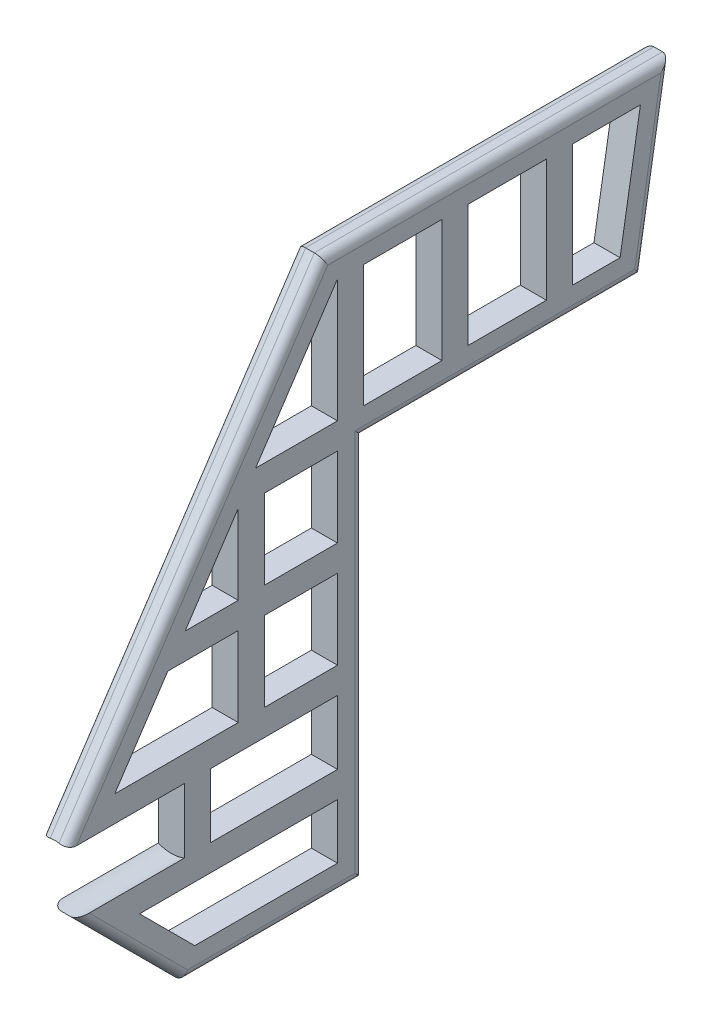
ISO-10303-21;
HEADER;
FILE_DESCRIPTION(('STEP AP214'),'2;1');
FILE_NAME('part.step','',(''),(''),'','','');
FILE_SCHEMA(('AUTOMOTIVE_DESIGN { 1 0 10303 214 1 1 1 1 }'));
ENDSEC;
DATA;
#1=APPLICATION_CONTEXT('core data for automotive mechanical design processes');
#2=APPLICATION_PROTOCOL_DEFINITION('international standard','automotive_design',2000,#1);
#3=PRODUCT_CONTEXT('',#1,'mechanical');
#4=PRODUCT('Part','Part','',(#3));
#5=PRODUCT_RELATED_PRODUCT_CATEGORY('part','',(#4));
#6=PRODUCT_DEFINITION_FORMATION('','',#4);
#7=PRODUCT_DEFINITION_CONTEXT('part definition',#1,'design');
#8=PRODUCT_DEFINITION('design','',#6,#7);
#9=PRODUCT_DEFINITION_SHAPE('','',#8);
#10=(LENGTH_UNIT() NAMED_UNIT(*) SI_UNIT(.MILLI.,.METRE.));
#11=(NAMED_UNIT(*) PLANE_ANGLE_UNIT() SI_UNIT($,.RADIAN.));
#12=(NAMED_UNIT(*) SI_UNIT($,.STERADIAN.) SOLID_ANGLE_UNIT());
#13=UNCERTAINTY_MEASURE_WITH_UNIT(LENGTH_MEASURE(1.E-05),#10,'distance_accuracy_value','');
#14=(GEOMETRIC_REPRESENTATION_CONTEXT(3) GLOBAL_UNCERTAINTY_ASSIGNED_CONTEXT((#13)) GLOBAL_UNIT_ASSIGNED_CONTEXT((#10,
#11,#12)) REPRESENTATION_CONTEXT('',''));
#15=CARTESIAN_POINT('',(0.,0.,0.));
#16=DIRECTION('',(0.,0.,1.));
#17=DIRECTION('',(1.,0.,0.));
#18=AXIS2_PLACEMENT_3D('',#15,#16,#17);
#19=CARTESIAN_POINT('',(0.,36.0234583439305,45.3763654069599));
#20=DIRECTION('',(0.,-1.,0.));
#21=DIRECTION('',(0.,0.,-1.));
#22=AXIS2_PLACEMENT_3D('',#19,#20,#21);
#23=PLANE('',#22);
#24=DIRECTION('',(-1.,0.,0.));
#25=VECTOR('',#24,1.);
#26=CARTESIAN_POINT('',(4.7625,36.0234583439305,22.8585332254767));
#27=LINE('',#26,#25);
#28=CARTESIAN_POINT('',(4.7625,36.0234583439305,22.8585332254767));
#29=VERTEX_POINT('',#28);
#30=CARTESIAN_POINT('',(0.,36.0234583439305,22.8585332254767));
#31=VERTEX_POINT('',#30);
#32=EDGE_CURVE('E424',#29,#31,#27,.T.);
#33=ORIENTED_EDGE('',*,*,#32,.T.);
#34=DIRECTION('',(0.,0.,-1.));
#35=VECTOR('',#34,1.);
#36=CARTESIAN_POINT('',(0.,36.0234583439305,45.3763654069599));
#37=LINE('',#36,#35);
#38=CARTESIAN_POINT('',(0.,36.0234583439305,45.3763654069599));
#39=VERTEX_POINT('',#38);
#40=EDGE_CURVE('E406',#39,#31,#37,.T.);
#41=ORIENTED_EDGE('',*,*,#40,.F.);
#42=DIRECTION('',(1.,0.,0.));
#43=VECTOR('',#42,1.);
#44=CARTESIAN_POINT('',(0.,36.0234583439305,45.3763654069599));
#45=LINE('',#44,#43);
#46=CARTESIAN_POINT('',(4.7625,36.0234583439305,45.3763654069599));
#47=VERTEX_POINT('',#46);
#48=EDGE_CURVE('E628',#39,#47,#45,.T.);
#49=ORIENTED_EDGE('',*,*,#48,.T.);
#50=DIRECTION('',(0.,0.,1.));
#51=VECTOR('',#50,1.);
#52=CARTESIAN_POINT('',(4.7625,36.0234583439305,0.));
#53=LINE('',#52,#51);
#54=EDGE_CURVE('E670',#29,#47,#53,.T.);
#55=ORIENTED_EDGE('',*,*,#54,.F.);
#56=EDGE_LOOP('',(#33,#41,#49,#55));
#57=FACE_BOUND('',#56,.T.);
#58=ADVANCED_FACE('F33',(#57),#23,.F.);
#59=DIRECTION('',(1.,0.,0.));
#60=VECTOR('',#59,1.);
#61=CARTESIAN_POINT('',(4.7625,36.0234583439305,18.0960332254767));
#62=LINE('',#61,#60);
#63=CARTESIAN_POINT('',(0.,36.0234583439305,18.0960332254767));
#64=VERTEX_POINT('',#63);
#65=CARTESIAN_POINT('',(4.7625,36.0234583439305,18.0960332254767));
#66=VERTEX_POINT('',#65);
#67=EDGE_CURVE('E399',#64,#66,#62,.T.);
#68=ORIENTED_EDGE('',*,*,#67,.T.);
#69=CARTESIAN_POINT('',(4.7625,36.0234583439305,4.7625));
#70=VERTEX_POINT('',#69);
#71=EDGE_CURVE('E672',#70,#66,#53,.T.);
#72=ORIENTED_EDGE('',*,*,#71,.F.);
#73=DIRECTION('',(1.,0.,0.));
#74=VECTOR('',#73,1.);
#75=CARTESIAN_POINT('',(4.7625,36.0234583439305,4.7625));
#76=LINE('',#75,#74);
#77=CARTESIAN_POINT('',(0.,36.0234583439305,4.7625));
#78=VERTEX_POINT('',#77);
#79=EDGE_CURVE('E402',#78,#70,#76,.T.);
#80=ORIENTED_EDGE('',*,*,#79,.F.);
#81=EDGE_CURVE('E394',#64,#78,#37,.T.);
#82=ORIENTED_EDGE('',*,*,#81,.F.);
#83=EDGE_LOOP('',(#68,#72,#80,#82));
#84=FACE_BOUND('',#83,.T.);
#85=ADVANCED_FACE('F396',(#84),#23,.F.);
#86=CARTESIAN_POINT('',(0.,69.85,41.5305598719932));
#87=DIRECTION('',(0.,1.,0.));
#88=DIRECTION('',(0.,0.,1.));
#89=AXIS2_PLACEMENT_3D('',#86,#87,#88);
#90=PLANE('',#89);
#91=DIRECTION('',(1.,0.,0.));
#92=VECTOR('',#91,1.);
#93=CARTESIAN_POINT('',(4.7625,69.85,18.0960332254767));
#94=LINE('',#93,#92);
#95=CARTESIAN_POINT('',(0.,69.85,18.0960332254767));
#96=VERTEX_POINT('',#95);
#97=CARTESIAN_POINT('',(4.7625,69.85,18.0960332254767));
#98=VERTEX_POINT('',#97);
#99=EDGE_CURVE('E417',#96,#98,#94,.T.);
#100=ORIENTED_EDGE('',*,*,#99,.F.);
#101=DIRECTION('',(0.,0.,-1.));
#102=VECTOR('',#101,1.);
#103=CARTESIAN_POINT('',(0.,69.85,41.5305598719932));
#104=LINE('',#103,#102);
#105=CARTESIAN_POINT('',(0.,69.85,4.7625));
#106=VERTEX_POINT('',#105);
#107=EDGE_CURVE('E479',#96,#106,#104,.T.);
#108=ORIENTED_EDGE('',*,*,#107,.T.);
#109=DIRECTION('',(1.,0.,0.));
#110=VECTOR('',#109,1.);
#111=CARTESIAN_POINT('',(0.,69.85,4.7625));
#112=LINE('',#111,#110);
#113=CARTESIAN_POINT('',(4.7625,69.85,4.7625));
#114=VERTEX_POINT('',#113);
#115=EDGE_CURVE('E475',#106,#114,#112,.T.);
#116=ORIENTED_EDGE('',*,*,#115,.T.);
#117=DIRECTION('',(0.,0.,-1.));
#118=VECTOR('',#117,1.);
#119=CARTESIAN_POINT('',(4.7625,69.85,41.5305598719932));
#120=LINE('',#119,#118);
#121=EDGE_CURVE('E478',#98,#114,#120,.T.);
#122=ORIENTED_EDGE('',*,*,#121,.F.);
#123=EDGE_LOOP('',(#100,#108,#116,#122));
#124=FACE_BOUND('',#123,.T.);
#125=ADVANCED_FACE('F792',(#124),#90,.F.);
#126=CARTESIAN_POINT('',(0.,50.5554791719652,41.5305598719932));
#127=DIRECTION('',(0.,1.,0.));
#128=DIRECTION('',(0.,0.,1.));
#129=AXIS2_PLACEMENT_3D('',#126,#127,#128);
#130=PLANE('',#129);
#131=DIRECTION('',(-1.,0.,0.));
#132=VECTOR('',#131,1.);
#133=CARTESIAN_POINT('',(0.,50.5554791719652,22.8585332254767));
#134=LINE('',#133,#132);
#135=CARTESIAN_POINT('',(4.7625,50.5554791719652,22.8585332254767));
#136=VERTEX_POINT('',#135);
#137=CARTESIAN_POINT('',(0.,50.5554791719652,22.8585332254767));
#138=VERTEX_POINT('',#137);
#139=EDGE_CURVE('E442',#136,#138,#134,.T.);
#140=ORIENTED_EDGE('',*,*,#139,.F.);
#141=DIRECTION('',(0.,0.,-1.));
#142=VECTOR('',#141,1.);
#143=CARTESIAN_POINT('',(4.7625,50.5554791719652,41.5305598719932));
#144=LINE('',#143,#142);
#145=CARTESIAN_POINT('',(4.7625,50.5554791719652,35.7026124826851));
#146=VERTEX_POINT('',#145);
#147=EDGE_CURVE('E463',#146,#136,#144,.T.);
#148=ORIENTED_EDGE('',*,*,#147,.F.);
#149=DIRECTION('',(1.,0.,0.));
#150=VECTOR('',#149,1.);
#151=CARTESIAN_POINT('',(0.,50.5554791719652,35.7026124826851));
#152=LINE('',#151,#150);
#153=CARTESIAN_POINT('',(0.,50.5554791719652,35.7026124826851));
#154=VERTEX_POINT('',#153);
#155=EDGE_CURVE('E456',#154,#146,#152,.T.);
#156=ORIENTED_EDGE('',*,*,#155,.F.);
#157=DIRECTION('',(0.,0.,-1.));
#158=VECTOR('',#157,1.);
#159=CARTESIAN_POINT('',(0.,50.5554791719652,41.5305598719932));
#160=LINE('',#159,#158);
#161=EDGE_CURVE('E455',#154,#138,#160,.T.);
#162=ORIENTED_EDGE('',*,*,#161,.T.);
#163=EDGE_LOOP('',(#140,#148,#156,#162));
#164=FACE_BOUND('',#163,.T.);
#165=ADVANCED_FACE('F1073',(#164),#130,.F.);
#166=DIRECTION('',(1.,0.,0.));
#167=VECTOR('',#166,1.);
#168=CARTESIAN_POINT('',(0.,50.5554791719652,18.0960332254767));
#169=LINE('',#168,#167);
#170=CARTESIAN_POINT('',(0.,50.5554791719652,18.0960332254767));
#171=VERTEX_POINT('',#170);
#172=CARTESIAN_POINT('',(4.7625,50.5554791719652,18.0960332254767));
#173=VERTEX_POINT('',#172);
#174=EDGE_CURVE('E426',#171,#173,#169,.T.);
#175=ORIENTED_EDGE('',*,*,#174,.F.);
#176=CARTESIAN_POINT('',(0.,50.5554791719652,4.7625));
#177=VERTEX_POINT('',#176);
#178=EDGE_CURVE('E414',#171,#177,#160,.T.);
#179=ORIENTED_EDGE('',*,*,#178,.T.);
#180=DIRECTION('',(1.,0.,0.));
#181=VECTOR('',#180,1.);
#182=CARTESIAN_POINT('',(0.,50.5554791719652,4.7625));
#183=LINE('',#182,#181);
#184=CARTESIAN_POINT('',(4.7625,50.5554791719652,4.7625));
#185=VERTEX_POINT('',#184);
#186=EDGE_CURVE('E451',#177,#185,#183,.T.);
#187=ORIENTED_EDGE('',*,*,#186,.T.);
#188=EDGE_CURVE('E454',#173,#185,#144,.T.);
#189=ORIENTED_EDGE('',*,*,#188,.F.);
#190=EDGE_LOOP('',(#175,#179,#187,#189));
#191=FACE_BOUND('',#190,.T.);
#192=ADVANCED_FACE('F1081',(#191),#130,.F.);
#193=CARTESIAN_POINT('',(0.,55.3179791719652,41.5305598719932));
#194=DIRECTION('',(0.,-1.,0.));
#195=DIRECTION('',(0.,0.,-1.));
#196=AXIS2_PLACEMENT_3D('',#193,#194,#195);
#197=PLANE('',#196);
#198=DIRECTION('',(1.,0.,0.));
#199=VECTOR('',#198,1.);
#200=CARTESIAN_POINT('',(0.,55.3179791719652,22.8585332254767));
#201=LINE('',#200,#199);
#202=CARTESIAN_POINT('',(0.,55.3179791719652,22.8585332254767));
#203=VERTEX_POINT('',#202);
#204=CARTESIAN_POINT('',(4.7625,55.3179791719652,22.8585332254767));
#205=VERTEX_POINT('',#204);
#206=EDGE_CURVE('E713',#203,#205,#201,.T.);
#207=ORIENTED_EDGE('',*,*,#206,.F.);
#208=DIRECTION('',(0.,0.,-1.));
#209=VECTOR('',#208,1.);
#210=CARTESIAN_POINT('',(0.,55.3179791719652,41.5305598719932));
#211=LINE('',#210,#209);
#212=CARTESIAN_POINT('',(0.,55.3179791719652,32.5322861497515));
#213=VERTEX_POINT('',#212);
#214=EDGE_CURVE('E468',#213,#203,#211,.T.);
#215=ORIENTED_EDGE('',*,*,#214,.F.);
#216=DIRECTION('',(-1.,0.,0.));
#217=VECTOR('',#216,1.);
#218=CARTESIAN_POINT('',(0.,55.3179791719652,32.5322861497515));
#219=LINE('',#218,#217);
#220=CARTESIAN_POINT('',(4.7625,55.3179791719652,32.5322861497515));
#221=VERTEX_POINT('',#220);
#222=EDGE_CURVE('E449',#221,#213,#219,.T.);
#223=ORIENTED_EDGE('',*,*,#222,.F.);
#224=DIRECTION('',(0.,0.,-1.));
#225=VECTOR('',#224,1.);
#226=CARTESIAN_POINT('',(4.7625,55.3179791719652,41.5305598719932));
#227=LINE('',#226,#225);
#228=EDGE_CURVE('E450',#221,#205,#227,.T.);
#229=ORIENTED_EDGE('',*,*,#228,.T.);
#230=EDGE_LOOP('',(#207,#215,#223,#229));
#231=FACE_BOUND('',#230,.T.);
#232=ADVANCED_FACE('F1083',(#231),#197,.F.);
#233=DIRECTION('',(-1.,0.,0.));
#234=VECTOR('',#233,1.);
#235=CARTESIAN_POINT('',(0.,55.3179791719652,18.0960332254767));
#236=LINE('',#235,#234);
#237=CARTESIAN_POINT('',(4.7625,55.3179791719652,18.0960332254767));
#238=VERTEX_POINT('',#237);
#239=CARTESIAN_POINT('',(0.,55.3179791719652,18.0960332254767));
#240=VERTEX_POINT('',#239);
#241=EDGE_CURVE('E710',#238,#240,#236,.T.);
#242=ORIENTED_EDGE('',*,*,#241,.F.);
#243=CARTESIAN_POINT('',(4.7625,55.3179791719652,4.7625));
#244=VERTEX_POINT('',#243);
#245=EDGE_CURVE('E466',#238,#244,#227,.T.);
#246=ORIENTED_EDGE('',*,*,#245,.T.);
#247=DIRECTION('',(-1.,0.,0.));
#248=VECTOR('',#247,1.);
#249=CARTESIAN_POINT('',(0.,55.3179791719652,4.7625));
#250=LINE('',#249,#248);
#251=CARTESIAN_POINT('',(0.,55.3179791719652,4.7625));
#252=VERTEX_POINT('',#251);
#253=EDGE_CURVE('E446',#244,#252,#250,.T.);
#254=ORIENTED_EDGE('',*,*,#253,.T.);
#255=EDGE_CURVE('E445',#240,#252,#211,.T.);
#256=ORIENTED_EDGE('',*,*,#255,.F.);
#257=EDGE_LOOP('',(#242,#246,#254,#256));
#258=FACE_BOUND('',#257,.T.);
#259=ADVANCED_FACE('F1086',(#258),#197,.F.);
#260=CARTESIAN_POINT('',(0.,4.7625,4.7625));
#261=DIRECTION('',(0.,0.,-1.));
#262=DIRECTION('',(0.,1.,0.));
#263=AXIS2_PLACEMENT_3D('',#260,#261,#262);
#264=PLANE('',#263);
#265=ORIENTED_EDGE('',*,*,#186,.F.);
#266=DIRECTION('',(0.,1.,0.));
#267=VECTOR('',#266,1.);
#268=CARTESIAN_POINT('',(0.,4.7625,4.7625));
#269=LINE('',#268,#267);
#270=EDGE_CURVE('E599',#78,#177,#269,.T.);
#271=ORIENTED_EDGE('',*,*,#270,.F.);
#272=ORIENTED_EDGE('',*,*,#79,.T.);
#273=DIRECTION('',(0.,-1.,0.));
#274=VECTOR('',#273,1.);
#275=CARTESIAN_POINT('',(4.7625,0.,4.7625));
#276=LINE('',#275,#274);
#277=EDGE_CURVE('E652',#185,#70,#276,.T.);
#278=ORIENTED_EDGE('',*,*,#277,.F.);
#279=EDGE_LOOP('',(#265,#271,#272,#278));
#280=FACE_BOUND('',#279,.T.);
#281=ADVANCED_FACE('F827',(#280),#264,.F.);
#282=ORIENTED_EDGE('',*,*,#253,.F.);
#283=EDGE_CURVE('E651',#114,#244,#276,.T.);
#284=ORIENTED_EDGE('',*,*,#283,.F.);
#285=ORIENTED_EDGE('',*,*,#115,.F.);
#286=EDGE_CURVE('E598',#252,#106,#269,.T.);
#287=ORIENTED_EDGE('',*,*,#286,.F.);
#288=EDGE_LOOP('',(#282,#284,#285,#287));
#289=FACE_BOUND('',#288,.T.);
#290=ADVANCED_FACE('F800',(#289),#264,.F.);
#291=CARTESIAN_POINT('',(0.,96.9068101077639,4.84721195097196));
#292=DIRECTION('',(0.,0.554134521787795,0.832427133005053));
#293=DIRECTION('',(0.,-0.832427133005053,0.554134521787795));
#294=AXIS2_PLACEMENT_3D('',#291,#292,#293);
#295=PLANE('',#294);
#296=ORIENTED_EDGE('',*,*,#155,.T.);
#297=DIRECTION('',(0.,0.832427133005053,-0.554134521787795));
#298=VECTOR('',#297,1.);
#299=CARTESIAN_POINT('',(4.7625,31.9926017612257,48.0596474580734));
#300=LINE('',#299,#298);
#301=EDGE_CURVE('E667',#47,#146,#300,.T.);
#302=ORIENTED_EDGE('',*,*,#301,.F.);
#303=ORIENTED_EDGE('',*,*,#48,.F.);
#304=DIRECTION('',(0.,-0.832427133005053,0.554134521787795));
#305=VECTOR('',#304,1.);
#306=CARTESIAN_POINT('',(0.,96.9068101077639,4.84721195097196));
#307=LINE('',#306,#305);
#308=EDGE_CURVE('E611',#154,#39,#307,.T.);
#309=ORIENTED_EDGE('',*,*,#308,.F.);
#310=EDGE_LOOP('',(#296,#302,#303,#309));
#311=FACE_BOUND('',#310,.T.);
#312=ADVANCED_FACE('F796',(#311),#295,.F.);
#313=ORIENTED_EDGE('',*,*,#222,.T.);
#314=CARTESIAN_POINT('',(0.,69.85,22.8585332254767));
#315=VERTEX_POINT('',#314);
#316=EDGE_CURVE('E614',#315,#213,#307,.T.);
#317=ORIENTED_EDGE('',*,*,#316,.F.);
#318=DIRECTION('',(1.,0.,0.));
#319=VECTOR('',#318,1.);
#320=CARTESIAN_POINT('',(0.,69.85,22.8585332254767));
#321=LINE('',#320,#319);
#322=CARTESIAN_POINT('',(4.7625,69.85,22.8585332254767));
#323=VERTEX_POINT('',#322);
#324=EDGE_CURVE('E480',#315,#323,#321,.T.);
#325=ORIENTED_EDGE('',*,*,#324,.T.);
#326=EDGE_CURVE('E671',#221,#323,#300,.T.);
#327=ORIENTED_EDGE('',*,*,#326,.F.);
#328=EDGE_LOOP('',(#313,#317,#325,#327));
#329=FACE_BOUND('',#328,.T.);
#330=ADVANCED_FACE('F799',(#329),#295,.F.);
#331=DIRECTION('',(-1.,0.,0.));
#332=VECTOR('',#331,1.);
#333=CARTESIAN_POINT('',(0.,74.6125,4.7625));
#334=LINE('',#333,#332);
#335=CARTESIAN_POINT('',(4.7625,74.6125,4.7625));
#336=VERTEX_POINT('',#335);
#337=CARTESIAN_POINT('',(0.,74.6125,4.7625));
#338=VERTEX_POINT('',#337);
#339=EDGE_CURVE('E471',#336,#338,#334,.T.);
#340=ORIENTED_EDGE('',*,*,#339,.F.);
#341=CARTESIAN_POINT('',(4.7625,96.9068101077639,4.7625));
#342=VERTEX_POINT('',#341);
#343=EDGE_CURVE('E647',#342,#336,#276,.T.);
#344=ORIENTED_EDGE('',*,*,#343,.F.);
#345=DIRECTION('',(1.,0.,0.));
#346=VECTOR('',#345,1.);
#347=CARTESIAN_POINT('',(0.,96.9068101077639,4.7625));
#348=LINE('',#347,#346);
#349=CARTESIAN_POINT('',(0.,96.9068101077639,4.76249999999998));
#350=VERTEX_POINT('',#349);
#351=EDGE_CURVE('E562',#350,#342,#348,.T.);
#352=ORIENTED_EDGE('',*,*,#351,.F.);
#353=EDGE_CURVE('E592',#338,#350,#269,.T.);
#354=ORIENTED_EDGE('',*,*,#353,.F.);
#355=EDGE_LOOP('',(#340,#344,#352,#354));
#356=FACE_BOUND('',#355,.T.);
#357=ADVANCED_FACE('F1279',(#356),#264,.F.);
#358=DIRECTION('',(-1.,0.,0.));
#359=VECTOR('',#358,1.);
#360=CARTESIAN_POINT('',(0.,74.6125,19.6882068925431));
#361=LINE('',#360,#359);
#362=CARTESIAN_POINT('',(4.7625,74.6125,19.6882068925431));
#363=VERTEX_POINT('',#362);
#364=CARTESIAN_POINT('',(0.,74.6125,19.6882068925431));
#365=VERTEX_POINT('',#364);
#366=EDGE_CURVE('E473',#363,#365,#361,.T.);
#367=ORIENTED_EDGE('',*,*,#366,.T.);
#368=CARTESIAN_POINT('',(0.,96.9068101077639,4.84721195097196));
#369=VERTEX_POINT('',#368);
#370=EDGE_CURVE('E407',#369,#365,#307,.T.);
#371=ORIENTED_EDGE('',*,*,#370,.F.);
#372=DIRECTION('',(1.,0.,0.));
#373=VECTOR('',#372,1.);
#374=CARTESIAN_POINT('',(0.,96.9068101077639,4.84721195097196));
#375=LINE('',#374,#373);
#376=CARTESIAN_POINT('',(4.7625,96.9068101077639,4.84721195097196));
#377=VERTEX_POINT('',#376);
#378=EDGE_CURVE('E631',#369,#377,#375,.T.);
#379=ORIENTED_EDGE('',*,*,#378,.T.);
#380=EDGE_CURVE('E665',#363,#377,#300,.T.);
#381=ORIENTED_EDGE('',*,*,#380,.F.);
#382=EDGE_LOOP('',(#367,#371,#379,#381));
#383=FACE_BOUND('',#382,.T.);
#384=ADVANCED_FACE('F802',(#383),#295,.F.);
#385=CARTESIAN_POINT('',(0.,36.0234583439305,27.9154132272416));
#386=DIRECTION('',(0.,0.,1.));
#387=DIRECTION('',(1.,0.,0.));
#388=AXIS2_PLACEMENT_3D('',#385,#386,#387);
#389=PLANE('',#388);
#390=DIRECTION('',(1.,0.,0.));
#391=VECTOR('',#390,1.);
#392=CARTESIAN_POINT('',(4.7625,19.5769583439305,27.9154132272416));
#393=LINE('',#392,#391);
#394=CARTESIAN_POINT('',(0.,19.5769583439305,27.9154132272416));
#395=VERTEX_POINT('',#394);
#396=CARTESIAN_POINT('',(4.7625,19.5769583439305,27.9154132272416));
#397=VERTEX_POINT('',#396);
#398=EDGE_CURVE('E490',#395,#397,#393,.T.);
#399=ORIENTED_EDGE('',*,*,#398,.F.);
#400=DIRECTION('',(0.,-1.,0.));
#401=VECTOR('',#400,1.);
#402=CARTESIAN_POINT('',(0.,36.0234583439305,27.9154132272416));
#403=LINE('',#402,#401);
#404=CARTESIAN_POINT('',(0.,31.2609583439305,27.9154132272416));
#405=VERTEX_POINT('',#404);
#406=EDGE_CURVE('E617',#405,#395,#403,.T.);
#407=ORIENTED_EDGE('',*,*,#406,.F.);
#408=DIRECTION('',(-1.,0.,0.));
#409=VECTOR('',#408,1.);
#410=CARTESIAN_POINT('',(4.7625,31.2609583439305,27.9154132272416));
#411=LINE('',#410,#409);
#412=CARTESIAN_POINT('',(4.7625,31.2609583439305,27.9154132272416));
#413=VERTEX_POINT('',#412);
#414=EDGE_CURVE('E503',#413,#405,#411,.T.);
#415=ORIENTED_EDGE('',*,*,#414,.F.);
#416=DIRECTION('',(0.,1.,0.));
#417=VECTOR('',#416,1.);
#418=CARTESIAN_POINT('',(4.7625,0.,27.9154132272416));
#419=LINE('',#418,#417);
#420=EDGE_CURVE('E674',#397,#413,#419,.T.);
#421=ORIENTED_EDGE('',*,*,#420,.F.);
#422=EDGE_LOOP('',(#399,#407,#415,#421));
#423=FACE_BOUND('',#422,.T.);
#424=ADVANCED_FACE('F795',(#423),#389,.F.);
#425=DIRECTION('',(-1.,0.,0.));
#426=VECTOR('',#425,1.);
#427=CARTESIAN_POINT('',(4.7625,14.8144583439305,4.7625));
#428=LINE('',#427,#426);
#429=CARTESIAN_POINT('',(4.7625,14.8144583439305,4.7625));
#430=VERTEX_POINT('',#429);
#431=CARTESIAN_POINT('',(0.,14.8144583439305,4.7625));
#432=VERTEX_POINT('',#431);
#433=EDGE_CURVE('E495',#430,#432,#428,.T.);
#434=ORIENTED_EDGE('',*,*,#433,.T.);
#435=CARTESIAN_POINT('',(0.,4.7625,4.7625));
#436=VERTEX_POINT('',#435);
#437=EDGE_CURVE('E593',#436,#432,#269,.T.);
#438=ORIENTED_EDGE('',*,*,#437,.F.);
#439=DIRECTION('',(1.,0.,0.));
#440=VECTOR('',#439,1.);
#441=CARTESIAN_POINT('',(0.,4.7625,4.7625));
#442=LINE('',#441,#440);
#443=CARTESIAN_POINT('',(4.7625,4.7625,4.7625));
#444=VERTEX_POINT('',#443);
#445=EDGE_CURVE('E640',#436,#444,#442,.T.);
#446=ORIENTED_EDGE('',*,*,#445,.T.);
#447=EDGE_CURVE('E646',#430,#444,#276,.T.);
#448=ORIENTED_EDGE('',*,*,#447,.F.);
#449=EDGE_LOOP('',(#434,#438,#446,#448));
#450=FACE_BOUND('',#449,.T.);
#451=ADVANCED_FACE('F822',(#450),#264,.F.);
#452=DIRECTION('',(1.,0.,0.));
#453=VECTOR('',#452,1.);
#454=CARTESIAN_POINT('',(4.7625,19.5769583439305,4.7625));
#455=LINE('',#454,#453);
#456=CARTESIAN_POINT('',(0.,19.5769583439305,4.7625));
#457=VERTEX_POINT('',#456);
#458=CARTESIAN_POINT('',(4.7625,19.5769583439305,4.7625));
#459=VERTEX_POINT('',#458);
#460=EDGE_CURVE('E493',#457,#459,#455,.T.);
#461=ORIENTED_EDGE('',*,*,#460,.T.);
#462=CARTESIAN_POINT('',(4.7625,31.2609583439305,4.7625));
#463=VERTEX_POINT('',#462);
#464=EDGE_CURVE('E653',#463,#459,#276,.T.);
#465=ORIENTED_EDGE('',*,*,#464,.F.);
#466=DIRECTION('',(-1.,0.,0.));
#467=VECTOR('',#466,1.);
#468=CARTESIAN_POINT('',(4.7625,31.2609583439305,4.7625));
#469=LINE('',#468,#467);
#470=CARTESIAN_POINT('',(0.,31.2609583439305,4.7625));
#471=VERTEX_POINT('',#470);
#472=EDGE_CURVE('E507',#463,#471,#469,.T.);
#473=ORIENTED_EDGE('',*,*,#472,.T.);
#474=EDGE_CURVE('E597',#457,#471,#269,.T.);
#475=ORIENTED_EDGE('',*,*,#474,.F.);
#476=EDGE_LOOP('',(#461,#465,#473,#475));
#477=FACE_BOUND('',#476,.T.);
#478=ADVANCED_FACE('F825',(#477),#264,.F.);
#479=CARTESIAN_POINT('',(0.,96.9068101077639,-50.4801811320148));
#480=DIRECTION('',(0.,1.,0.));
#481=DIRECTION('',(0.,0.,1.));
#482=AXIS2_PLACEMENT_3D('',#479,#480,#481);
#483=PLANE('',#482);
#484=DIRECTION('',(1.,0.,0.));
#485=VECTOR('',#484,1.);
#486=CARTESIAN_POINT('',(0.,96.9068101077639,-33.3375));
#487=LINE('',#486,#485);
#488=CARTESIAN_POINT('',(0.,96.9068101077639,-33.3375));
#489=VERTEX_POINT('',#488);
#490=CARTESIAN_POINT('',(4.7625,96.9068101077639,-33.3375));
#491=VERTEX_POINT('',#490);
#492=EDGE_CURVE('E525',#489,#491,#487,.T.);
#493=ORIENTED_EDGE('',*,*,#492,.T.);
#494=DIRECTION('',(0.,0.,-1.));
#495=VECTOR('',#494,1.);
#496=CARTESIAN_POINT('',(4.7625,96.9068101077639,0.));
#497=LINE('',#496,#495);
#498=CARTESIAN_POINT('',(4.7625,96.9068101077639,-19.05));
#499=VERTEX_POINT('',#498);
#500=EDGE_CURVE('E1646',#499,#491,#497,.T.);
#501=ORIENTED_EDGE('',*,*,#500,.F.);
#502=DIRECTION('',(-1.,0.,0.));
#503=VECTOR('',#502,1.);
#504=CARTESIAN_POINT('',(0.,96.9068101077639,-19.05));
#505=LINE('',#504,#503);
#506=CARTESIAN_POINT('',(0.,96.9068101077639,-19.05));
#507=VERTEX_POINT('',#506);
#508=EDGE_CURVE('E538',#499,#507,#505,.T.);
#509=ORIENTED_EDGE('',*,*,#508,.T.);
#510=DIRECTION('',(0.,0.,1.));
#511=VECTOR('',#510,1.);
#512=CARTESIAN_POINT('',(0.,96.9068101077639,-50.4801811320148));
#513=LINE('',#512,#511);
#514=EDGE_CURVE('E612',#489,#507,#513,.T.);
#515=ORIENTED_EDGE('',*,*,#514,.F.);
#516=EDGE_LOOP('',(#493,#501,#509,#515));
#517=FACE_BOUND('',#516,.T.);
#518=ADVANCED_FACE('F809',(#517),#483,.F.);
#519=DIRECTION('',(-1.,0.,0.));
#520=VECTOR('',#519,1.);
#521=CARTESIAN_POINT('',(0.,96.9068101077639,-38.1));
#522=LINE('',#521,#520);
#523=CARTESIAN_POINT('',(4.7625,96.9068101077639,-38.1));
#524=VERTEX_POINT('',#523);
#525=CARTESIAN_POINT('',(0.,96.9068101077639,-38.1));
#526=VERTEX_POINT('',#525);
#527=EDGE_CURVE('E518',#524,#526,#522,.T.);
#528=ORIENTED_EDGE('',*,*,#527,.T.);
#529=CARTESIAN_POINT('',(0.,96.9068101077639,-50.4801811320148));
#530=VERTEX_POINT('',#529);
#531=EDGE_CURVE('E608',#530,#526,#513,.T.);
#532=ORIENTED_EDGE('',*,*,#531,.F.);
#533=DIRECTION('',(1.,0.,0.));
#534=VECTOR('',#533,1.);
#535=CARTESIAN_POINT('',(0.,96.9068101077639,-50.4801811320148));
#536=LINE('',#535,#534);
#537=CARTESIAN_POINT('',(4.7625,96.9068101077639,-50.4801811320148));
#538=VERTEX_POINT('',#537);
#539=EDGE_CURVE('E634',#530,#538,#536,.T.);
#540=ORIENTED_EDGE('',*,*,#539,.T.);
#541=EDGE_CURVE('E661',#524,#538,#497,.T.);
#542=ORIENTED_EDGE('',*,*,#541,.F.);
#543=EDGE_LOOP('',(#528,#532,#540,#542));
#544=FACE_BOUND('',#543,.T.);
#545=ADVANCED_FACE('F1180',(#544),#483,.F.);
#546=CARTESIAN_POINT('',(0.,74.6125,4.7625));
#547=DIRECTION('',(0.,-1.,0.));
#548=DIRECTION('',(0.,0.,-1.));
#549=AXIS2_PLACEMENT_3D('',#546,#547,#548);
#550=PLANE('',#549);
#551=DIRECTION('',(1.,0.,0.));
#552=VECTOR('',#551,1.);
#553=CARTESIAN_POINT('',(0.,74.6125,-33.3375));
#554=LINE('',#553,#552);
#555=CARTESIAN_POINT('',(0.,74.6125,-33.3375));
#556=VERTEX_POINT('',#555);
#557=CARTESIAN_POINT('',(4.7625,74.6125,-33.3375));
#558=VERTEX_POINT('',#557);
#559=EDGE_CURVE('E520',#556,#558,#554,.T.);
#560=ORIENTED_EDGE('',*,*,#559,.F.);
#561=DIRECTION('',(0.,0.,-1.));
#562=VECTOR('',#561,1.);
#563=CARTESIAN_POINT('',(0.,74.6125,4.7625));
#564=LINE('',#563,#562);
#565=CARTESIAN_POINT('',(0.,74.6125,-19.05));
#566=VERTEX_POINT('',#565);
#567=EDGE_CURVE('E604',#566,#556,#564,.T.);
#568=ORIENTED_EDGE('',*,*,#567,.F.);
#569=DIRECTION('',(-1.,0.,0.));
#570=VECTOR('',#569,1.);
#571=CARTESIAN_POINT('',(0.,74.6125,-19.05));
#572=LINE('',#571,#570);
#573=CARTESIAN_POINT('',(4.7625,74.6125,-19.05));
#574=VERTEX_POINT('',#573);
#575=EDGE_CURVE('E536',#574,#566,#572,.T.);
#576=ORIENTED_EDGE('',*,*,#575,.F.);
#577=DIRECTION('',(0.,0.,1.));
#578=VECTOR('',#577,1.);
#579=CARTESIAN_POINT('',(4.7625,74.6125,0.));
#580=LINE('',#579,#578);
#581=EDGE_CURVE('E658',#558,#574,#580,.T.);
#582=ORIENTED_EDGE('',*,*,#581,.F.);
#583=EDGE_LOOP('',(#560,#568,#576,#582));
#584=FACE_BOUND('',#583,.T.);
#585=ADVANCED_FACE('F820',(#584),#550,.F.);
#586=DIRECTION('',(-1.,0.,0.));
#587=VECTOR('',#586,1.);
#588=CARTESIAN_POINT('',(0.,74.6125,-38.1));
#589=LINE('',#588,#587);
#590=CARTESIAN_POINT('',(4.7625,74.6125,-38.1));
#591=VERTEX_POINT('',#590);
#592=CARTESIAN_POINT('',(0.,74.6125,-38.1));
#593=VERTEX_POINT('',#592);
#594=EDGE_CURVE('E516',#591,#593,#589,.T.);
#595=ORIENTED_EDGE('',*,*,#594,.F.);
#596=CARTESIAN_POINT('',(4.7625,74.6125,-46.765391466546));
#597=VERTEX_POINT('',#596);
#598=EDGE_CURVE('E654',#597,#591,#580,.T.);
#599=ORIENTED_EDGE('',*,*,#598,.F.);
#600=DIRECTION('',(1.,0.,0.));
#601=VECTOR('',#600,1.);
#602=CARTESIAN_POINT('',(0.,74.6125,-46.765391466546));
#603=LINE('',#602,#601);
#604=CARTESIAN_POINT('',(0.,74.6125,-46.765391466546));
#605=VERTEX_POINT('',#604);
#606=EDGE_CURVE('E637',#605,#597,#603,.T.);
#607=ORIENTED_EDGE('',*,*,#606,.F.);
#608=EDGE_CURVE('E596',#593,#605,#564,.T.);
#609=ORIENTED_EDGE('',*,*,#608,.F.);
#610=EDGE_LOOP('',(#595,#599,#607,#609));
#611=FACE_BOUND('',#610,.T.);
#612=ADVANCED_FACE('F821',(#611),#550,.F.);
#613=DIRECTION('',(1.,0.,0.));
#614=VECTOR('',#613,1.);
#615=CARTESIAN_POINT('',(0.,96.9068101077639,-14.2875));
#616=LINE('',#615,#614);
#617=CARTESIAN_POINT('',(0.,96.9068101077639,-14.2875));
#618=VERTEX_POINT('',#617);
#619=CARTESIAN_POINT('',(4.7625,96.9068101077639,-14.2875));
#620=VERTEX_POINT('',#619);
#621=EDGE_CURVE('E545',#618,#620,#616,.T.);
#622=ORIENTED_EDGE('',*,*,#621,.T.);
#623=CARTESIAN_POINT('',(4.7625,96.9068101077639,0.));
#624=VERTEX_POINT('',#623);
#625=EDGE_CURVE('E666',#624,#620,#497,.T.);
#626=ORIENTED_EDGE('',*,*,#625,.F.);
#627=DIRECTION('',(-1.,0.,0.));
#628=VECTOR('',#627,1.);
#629=CARTESIAN_POINT('',(0.,96.9068101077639,0.));
#630=LINE('',#629,#628);
#631=CARTESIAN_POINT('',(0.,96.9068101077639,0.));
#632=VERTEX_POINT('',#631);
#633=EDGE_CURVE('E560',#624,#632,#630,.T.);
#634=ORIENTED_EDGE('',*,*,#633,.T.);
#635=EDGE_CURVE('E1634',#618,#632,#513,.T.);
#636=ORIENTED_EDGE('',*,*,#635,.F.);
#637=EDGE_LOOP('',(#622,#626,#634,#636));
#638=FACE_BOUND('',#637,.T.);
#639=ADVANCED_FACE('F810',(#638),#483,.F.);
#640=DIRECTION('',(1.,0.,0.));
#641=VECTOR('',#640,1.);
#642=CARTESIAN_POINT('',(0.,74.6125,-14.2875));
#643=LINE('',#642,#641);
#644=CARTESIAN_POINT('',(0.,74.6125,-14.2875));
#645=VERTEX_POINT('',#644);
#646=CARTESIAN_POINT('',(4.7625,74.6125,-14.2875));
#647=VERTEX_POINT('',#646);
#648=EDGE_CURVE('E540',#645,#647,#643,.T.);
#649=ORIENTED_EDGE('',*,*,#648,.F.);
#650=CARTESIAN_POINT('',(0.,74.6125,0.));
#651=VERTEX_POINT('',#650);
#652=EDGE_CURVE('E600',#651,#645,#564,.T.);
#653=ORIENTED_EDGE('',*,*,#652,.F.);
#654=DIRECTION('',(-1.,0.,0.));
#655=VECTOR('',#654,1.);
#656=CARTESIAN_POINT('',(0.,74.6125,0.));
#657=LINE('',#656,#655);
#658=CARTESIAN_POINT('',(4.7625,74.6125,0.));
#659=VERTEX_POINT('',#658);
#660=EDGE_CURVE('E557',#659,#651,#657,.T.);
#661=ORIENTED_EDGE('',*,*,#660,.F.);
#662=EDGE_CURVE('E650',#647,#659,#580,.T.);
#663=ORIENTED_EDGE('',*,*,#662,.F.);
#664=EDGE_LOOP('',(#649,#653,#661,#663));
#665=FACE_BOUND('',#664,.T.);
#666=ADVANCED_FACE('F807',(#665),#550,.F.);
#667=ORIENTED_EDGE('',*,*,#351,.T.);
#668=EDGE_CURVE('E662',#377,#342,#497,.T.);
#669=ORIENTED_EDGE('',*,*,#668,.F.);
#670=ORIENTED_EDGE('',*,*,#378,.F.);
#671=EDGE_CURVE('E607',#350,#369,#513,.T.);
#672=ORIENTED_EDGE('',*,*,#671,.F.);
#673=EDGE_LOOP('',(#667,#669,#670,#672));
#674=FACE_BOUND('',#673,.T.);
#675=ADVANCED_FACE('F803',(#674),#483,.F.);
#676=CARTESIAN_POINT('',(4.7625,31.2609583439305,54.2679132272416));
#677=DIRECTION('',(0.,-0.554134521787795,-0.832427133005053));
#678=DIRECTION('',(0.,0.832427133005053,-0.554134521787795));
#679=AXIS2_PLACEMENT_3D('',#676,#677,#678);
#680=PLANE('',#679);
#681=DIRECTION('',(-1.,0.,0.));
#682=VECTOR('',#681,1.);
#683=CARTESIAN_POINT('',(4.7625,101.669310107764,7.39810710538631));
#684=LINE('',#683,#682);
#685=CARTESIAN_POINT('',(3.175,101.669310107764,7.39810710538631));
#686=VERTEX_POINT('',#685);
#687=CARTESIAN_POINT('',(1.5875,101.669310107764,7.39810710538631));
#688=VERTEX_POINT('',#687);
#689=EDGE_CURVE('E693',#686,#688,#684,.T.);
#690=ORIENTED_EDGE('',*,*,#689,.T.);
#691=DIRECTION('',(0.,-0.832427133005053,0.554134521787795));
#692=VECTOR('',#691,1.);
#693=CARTESIAN_POINT('',(1.5875,31.3055658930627,54.2382186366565));
#694=LINE('',#693,#692);
#695=CARTESIAN_POINT('',(1.5875,31.719153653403,53.9628993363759));
#696=VERTEX_POINT('',#695);
#697=EDGE_CURVE('E971',#688,#696,#694,.T.);
#698=ORIENTED_EDGE('',*,*,#697,.T.);
#699=CARTESIAN_POINT('',(2.38125,25.4189583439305,58.1568468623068));
#700=DIRECTION('',(0.,-0.554134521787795,-0.832427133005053));
#701=DIRECTION('',(0.,0.832427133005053,-0.554134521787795));
#702=AXIS2_PLACEMENT_3D('',#699,#700,#701);
#703=ELLIPSE('',#702,7.628295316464,6.35);
#704=CARTESIAN_POINT('',(3.175,31.719153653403,53.9628993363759));
#705=VERTEX_POINT('',#704);
#706=EDGE_CURVE('E580',#705,#696,#703,.F.);
#707=ORIENTED_EDGE('',*,*,#706,.F.);
#708=DIRECTION('',(0.,-0.832427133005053,0.554134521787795));
#709=VECTOR('',#708,1.);
#710=CARTESIAN_POINT('',(3.175,31.2609583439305,54.2679132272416));
#711=LINE('',#710,#709);
#712=EDGE_CURVE('E969',#705,#686,#711,.F.);
#713=ORIENTED_EDGE('',*,*,#712,.T.);
#714=EDGE_LOOP('',(#690,#698,#707,#713));
#715=FACE_BOUND('',#714,.T.);
#716=ADVANCED_FACE('F806',(#715),#680,.F.);
#717=CARTESIAN_POINT('',(4.7625,0.,0.));
#718=DIRECTION('',(-1.,0.,0.));
#719=DIRECTION('',(0.,0.,1.));
#720=AXIS2_PLACEMENT_3D('',#717,#718,#719);
#721=PLANE('',#720);
#722=ORIENTED_EDGE('',*,*,#147,.T.);
#723=DIRECTION('',(0.,1.,0.));
#724=VECTOR('',#723,1.);
#725=CARTESIAN_POINT('',(4.7625,29.2882662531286,22.8585332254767));
#726=LINE('',#725,#724);
#727=EDGE_CURVE('E431',#29,#136,#726,.T.);
#728=ORIENTED_EDGE('',*,*,#727,.F.);
#729=ORIENTED_EDGE('',*,*,#54,.T.);
#730=ORIENTED_EDGE('',*,*,#301,.T.);
#731=EDGE_LOOP('',(#722,#728,#729,#730));
#732=FACE_BOUND('',#731,.T.);
#733=ORIENTED_EDGE('',*,*,#245,.F.);
#734=DIRECTION('',(0.,1.,0.));
#735=VECTOR('',#734,1.);
#736=CARTESIAN_POINT('',(4.7625,29.2882662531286,18.0960332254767));
#737=LINE('',#736,#735);
#738=EDGE_CURVE('E440',#238,#98,#737,.T.);
#739=ORIENTED_EDGE('',*,*,#738,.T.);
#740=ORIENTED_EDGE('',*,*,#121,.T.);
#741=ORIENTED_EDGE('',*,*,#283,.T.);
#742=EDGE_LOOP('',(#733,#739,#740,#741));
#743=FACE_BOUND('',#742,.T.);
#744=EDGE_CURVE('E435',#205,#323,#726,.T.);
#745=ORIENTED_EDGE('',*,*,#744,.F.);
#746=ORIENTED_EDGE('',*,*,#228,.F.);
#747=ORIENTED_EDGE('',*,*,#326,.T.);
#748=EDGE_LOOP('',(#745,#746,#747));
#749=FACE_BOUND('',#748,.T.);
#750=EDGE_CURVE('E423',#66,#173,#737,.T.);
#751=ORIENTED_EDGE('',*,*,#750,.T.);
#752=ORIENTED_EDGE('',*,*,#188,.T.);
#753=ORIENTED_EDGE('',*,*,#277,.T.);
#754=ORIENTED_EDGE('',*,*,#71,.T.);
#755=EDGE_LOOP('',(#751,#752,#753,#754));
#756=FACE_BOUND('',#755,.T.);
#757=DIRECTION('',(0.,0.,-1.));
#758=VECTOR('',#757,1.);
#759=CARTESIAN_POINT('',(4.7625,19.5323507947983,54.2679132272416));
#760=LINE('',#759,#758);
#761=CARTESIAN_POINT('',(4.7625,19.5323507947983,50.0532867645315));
#762=VERTEX_POINT('',#761);
#763=CARTESIAN_POINT('',(4.7625,19.5323507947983,32.6779132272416));
#764=VERTEX_POINT('',#763);
#765=EDGE_CURVE('E578',#762,#764,#760,.T.);
#766=ORIENTED_EDGE('',*,*,#765,.F.);
#767=DIRECTION('',(0.,-0.707106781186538,-0.707106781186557));
#768=VECTOR('',#767,1.);
#769=CARTESIAN_POINT('',(4.7625,-15.2604679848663,15.2604679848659));
#770=LINE('',#769,#768);
#771=CARTESIAN_POINT('',(4.7625,1.5875,32.1084359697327));
#772=VERTEX_POINT('',#771);
#773=EDGE_CURVE('E11',#762,#772,#770,.T.);
#774=ORIENTED_EDGE('',*,*,#773,.T.);
#775=DIRECTION('',(0.,0.,-1.));
#776=VECTOR('',#775,1.);
#777=CARTESIAN_POINT('',(4.7625,1.5875,0.));
#778=LINE('',#777,#776);
#779=CARTESIAN_POINT('',(4.7625,1.5875,1.5875));
#780=VERTEX_POINT('',#779);
#781=EDGE_CURVE('E43',#772,#780,#778,.T.);
#782=ORIENTED_EDGE('',*,*,#781,.T.);
#783=DIRECTION('',(0.,1.,0.));
#784=VECTOR('',#783,1.);
#785=CARTESIAN_POINT('',(4.7625,0.,1.5875));
#786=LINE('',#785,#784);
#787=CARTESIAN_POINT('',(4.7625,71.4375,1.5875));
#788=VERTEX_POINT('',#787);
#789=EDGE_CURVE('E996',#780,#788,#786,.T.);
#790=ORIENTED_EDGE('',*,*,#789,.T.);
#791=DIRECTION('',(0.,0.,-1.));
#792=VECTOR('',#791,1.);
#793=CARTESIAN_POINT('',(4.7625,71.4375,0.));
#794=LINE('',#793,#792);
#795=CARTESIAN_POINT('',(4.7625,71.4375,-49.4551304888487));
#796=VERTEX_POINT('',#795);
#797=EDGE_CURVE('E994',#788,#796,#794,.T.);
#798=ORIENTED_EDGE('',*,*,#797,.T.);
#799=DIRECTION('',(0.,0.986400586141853,-0.164359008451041));
#800=VECTOR('',#799,1.);
#801=CARTESIAN_POINT('',(4.7625,-6.08805047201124,-36.5374347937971));
#802=LINE('',#801,#800);
#803=CARTESIAN_POINT('',(4.7625,100.081810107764,-54.2279889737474));
#804=VERTEX_POINT('',#803);
#805=EDGE_CURVE('E992',#796,#804,#802,.T.);
#806=ORIENTED_EDGE('',*,*,#805,.T.);
#807=DIRECTION('',(0.,0.,1.));
#808=VECTOR('',#807,1.);
#809=CARTESIAN_POINT('',(4.7625,100.081810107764,0.));
#810=LINE('',#809,#808);
#811=CARTESIAN_POINT('',(4.7625,100.081810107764,6.54780872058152));
#812=VERTEX_POINT('',#811);
#813=EDGE_CURVE('E990',#804,#812,#810,.T.);
#814=ORIENTED_EDGE('',*,*,#813,.T.);
#815=DIRECTION('',(0.,-0.832427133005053,0.554134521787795));
#816=VECTOR('',#815,1.);
#817=CARTESIAN_POINT('',(4.7625,33.7519788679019,50.7026036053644));
#818=LINE('',#817,#816);
#819=CARTESIAN_POINT('',(4.7625,31.3055658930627,52.3311448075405));
#820=VERTEX_POINT('',#819);
#821=EDGE_CURVE('E988',#812,#820,#818,.T.);
#822=ORIENTED_EDGE('',*,*,#821,.T.);
#823=DIRECTION('',(0.,0.,-1.));
#824=VECTOR('',#823,1.);
#825=CARTESIAN_POINT('',(4.7625,31.3055658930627,54.2679132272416));
#826=LINE('',#825,#824);
#827=CARTESIAN_POINT('',(4.7625,31.3055658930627,32.6779132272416));
#828=VERTEX_POINT('',#827);
#829=EDGE_CURVE('E583',#828,#820,#826,.F.);
#830=ORIENTED_EDGE('',*,*,#829,.F.);
#831=DIRECTION('',(0.,-1.,0.));
#832=VECTOR('',#831,1.);
#833=CARTESIAN_POINT('',(4.7625,19.5769583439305,32.6779132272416));
#834=LINE('',#833,#832);
#835=EDGE_CURVE('E682',#828,#764,#834,.T.);
#836=ORIENTED_EDGE('',*,*,#835,.T.);
#837=EDGE_LOOP('',(#766,#774,#782,#790,#798,#806,#814,#822,#830,#836));
#838=FACE_BOUND('',#837,.T.);
#839=DIRECTION('',(0.,-1.,0.));
#840=VECTOR('',#839,1.);
#841=CARTESIAN_POINT('',(4.7625,103.642002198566,0.));
#842=LINE('',#841,#840);
#843=EDGE_CURVE('E561',#624,#659,#842,.T.);
#844=ORIENTED_EDGE('',*,*,#843,.F.);
#845=ORIENTED_EDGE('',*,*,#625,.T.);
#846=DIRECTION('',(0.,-1.,0.));
#847=VECTOR('',#846,1.);
#848=CARTESIAN_POINT('',(4.7625,103.642002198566,-14.2875));
#849=LINE('',#848,#847);
#850=EDGE_CURVE('E543',#620,#647,#849,.T.);
#851=ORIENTED_EDGE('',*,*,#850,.T.);
#852=ORIENTED_EDGE('',*,*,#662,.T.);
#853=EDGE_LOOP('',(#844,#845,#851,#852));
#854=FACE_BOUND('',#853,.T.);
#855=DIRECTION('',(0.,-1.,0.));
#856=VECTOR('',#855,1.);
#857=CARTESIAN_POINT('',(4.7625,103.642002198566,-33.3375));
#858=LINE('',#857,#856);
#859=EDGE_CURVE('E523',#491,#558,#858,.T.);
#860=ORIENTED_EDGE('',*,*,#859,.T.);
#861=ORIENTED_EDGE('',*,*,#581,.T.);
#862=DIRECTION('',(0.,-1.,0.));
#863=VECTOR('',#862,1.);
#864=CARTESIAN_POINT('',(4.7625,103.642002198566,-19.05));
#865=LINE('',#864,#863);
#866=EDGE_CURVE('E539',#499,#574,#865,.T.);
#867=ORIENTED_EDGE('',*,*,#866,.F.);
#868=ORIENTED_EDGE('',*,*,#500,.T.);
#869=EDGE_LOOP('',(#860,#861,#867,#868));
#870=FACE_BOUND('',#869,.T.);
#871=ORIENTED_EDGE('',*,*,#598,.T.);
#872=DIRECTION('',(0.,-1.,0.));
#873=VECTOR('',#872,1.);
#874=CARTESIAN_POINT('',(4.7625,103.642002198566,-38.1));
#875=LINE('',#874,#873);
#876=EDGE_CURVE('E519',#524,#591,#875,.T.);
#877=ORIENTED_EDGE('',*,*,#876,.F.);
#878=ORIENTED_EDGE('',*,*,#541,.T.);
#879=DIRECTION('',(0.,-0.986400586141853,0.164359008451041));
#880=VECTOR('',#879,1.);
#881=CARTESIAN_POINT('',(4.7625,-5.56621062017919,-33.4056129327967));
#882=LINE('',#881,#880);
#883=EDGE_CURVE('E657',#538,#597,#882,.T.);
#884=ORIENTED_EDGE('',*,*,#883,.T.);
#885=EDGE_LOOP('',(#871,#877,#878,#884));
#886=FACE_BOUND('',#885,.T.);
#887=DIRECTION('',(0.,0.,-1.));
#888=VECTOR('',#887,1.);
#889=CARTESIAN_POINT('',(4.7625,14.8144583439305,0.));
#890=LINE('',#889,#888);
#891=CARTESIAN_POINT('',(4.7625,14.8144583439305,40.8452662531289));
#892=VERTEX_POINT('',#891);
#893=EDGE_CURVE('E676',#892,#430,#890,.T.);
#894=ORIENTED_EDGE('',*,*,#893,.T.);
#895=ORIENTED_EDGE('',*,*,#447,.T.);
#896=DIRECTION('',(0.,0.,1.));
#897=VECTOR('',#896,1.);
#898=CARTESIAN_POINT('',(4.7625,4.7625,0.));
#899=LINE('',#898,#897);
#900=CARTESIAN_POINT('',(4.7625,4.7625,30.7933079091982));
#901=VERTEX_POINT('',#900);
#902=EDGE_CURVE('E627',#444,#901,#899,.T.);
#903=ORIENTED_EDGE('',*,*,#902,.T.);
#904=DIRECTION('',(0.,0.707106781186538,0.707106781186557));
#905=VECTOR('',#904,1.);
#906=CARTESIAN_POINT('',(4.7625,-13.015403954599,13.0154039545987));
#907=LINE('',#906,#905);
#908=EDGE_CURVE('E678',#901,#892,#907,.T.);
#909=ORIENTED_EDGE('',*,*,#908,.T.);
#910=EDGE_LOOP('',(#894,#895,#903,#909));
#911=FACE_BOUND('',#910,.T.);
#912=DIRECTION('',(0.,0.,1.));
#913=VECTOR('',#912,1.);
#914=CARTESIAN_POINT('',(4.7625,19.5769583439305,-1.97269209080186));
#915=LINE('',#914,#913);
#916=EDGE_CURVE('E483',#459,#397,#915,.T.);
#917=ORIENTED_EDGE('',*,*,#916,.T.);
#918=ORIENTED_EDGE('',*,*,#420,.T.);
#919=DIRECTION('',(0.,0.,1.));
#920=VECTOR('',#919,1.);
#921=CARTESIAN_POINT('',(4.7625,31.2609583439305,-1.97269209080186));
#922=LINE('',#921,#920);
#923=EDGE_CURVE('E498',#463,#413,#922,.T.);
#924=ORIENTED_EDGE('',*,*,#923,.F.);
#925=ORIENTED_EDGE('',*,*,#464,.T.);
#926=EDGE_LOOP('',(#917,#918,#924,#925));
#927=FACE_BOUND('',#926,.T.);
#928=ORIENTED_EDGE('',*,*,#343,.T.);
#929=DIRECTION('',(0.,0.,-1.));
#930=VECTOR('',#929,1.);
#931=CARTESIAN_POINT('',(4.7625,74.6125,41.5305598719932));
#932=LINE('',#931,#930);
#933=EDGE_CURVE('E474',#363,#336,#932,.T.);
#934=ORIENTED_EDGE('',*,*,#933,.F.);
#935=ORIENTED_EDGE('',*,*,#380,.T.);
#936=ORIENTED_EDGE('',*,*,#668,.T.);
#937=EDGE_LOOP('',(#928,#934,#935,#936));
#938=FACE_BOUND('',#937,.T.);
#939=ADVANCED_FACE('F836',(#732,#743,#749,#756,#838,#854,#870,#886,#911,#927,#938),#721,.F.);
#940=CARTESIAN_POINT('',(0.,0.,0.));
#941=DIRECTION('',(-1.,0.,0.));
#942=DIRECTION('',(0.,0.,1.));
#943=AXIS2_PLACEMENT_3D('',#940,#941,#942);
#944=PLANE('',#943);
#945=DIRECTION('',(0.,1.,0.));
#946=VECTOR('',#945,1.);
#947=CARTESIAN_POINT('',(0.,29.2882662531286,22.8585332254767));
#948=LINE('',#947,#946);
#949=EDGE_CURVE('E436',#31,#138,#948,.T.);
#950=ORIENTED_EDGE('',*,*,#949,.T.);
#951=ORIENTED_EDGE('',*,*,#161,.F.);
#952=ORIENTED_EDGE('',*,*,#308,.T.);
#953=ORIENTED_EDGE('',*,*,#40,.T.);
#954=EDGE_LOOP('',(#950,#951,#952,#953));
#955=FACE_BOUND('',#954,.T.);
#956=DIRECTION('',(0.,1.,0.));
#957=VECTOR('',#956,1.);
#958=CARTESIAN_POINT('',(0.,29.2882662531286,18.0960332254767));
#959=LINE('',#958,#957);
#960=EDGE_CURVE('E418',#240,#96,#959,.T.);
#961=ORIENTED_EDGE('',*,*,#960,.F.);
#962=ORIENTED_EDGE('',*,*,#255,.T.);
#963=ORIENTED_EDGE('',*,*,#286,.T.);
#964=ORIENTED_EDGE('',*,*,#107,.F.);
#965=EDGE_LOOP('',(#961,#962,#963,#964));
#966=FACE_BOUND('',#965,.T.);
#967=EDGE_CURVE('E411',#64,#171,#959,.T.);
#968=ORIENTED_EDGE('',*,*,#967,.F.);
#969=ORIENTED_EDGE('',*,*,#81,.T.);
#970=ORIENTED_EDGE('',*,*,#270,.T.);
#971=ORIENTED_EDGE('',*,*,#178,.F.);
#972=EDGE_LOOP('',(#968,#969,#970,#971));
#973=FACE_BOUND('',#972,.T.);
#974=ORIENTED_EDGE('',*,*,#214,.T.);
#975=EDGE_CURVE('E434',#203,#315,#948,.T.);
#976=ORIENTED_EDGE('',*,*,#975,.T.);
#977=ORIENTED_EDGE('',*,*,#316,.T.);
#978=EDGE_LOOP('',(#974,#976,#977));
#979=FACE_BOUND('',#978,.T.);
#980=ORIENTED_EDGE('',*,*,#406,.T.);
#981=DIRECTION('',(0.,0.,1.));
#982=VECTOR('',#981,1.);
#983=CARTESIAN_POINT('',(0.,19.5769583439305,-1.97269209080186));
#984=LINE('',#983,#982);
#985=EDGE_CURVE('E494',#457,#395,#984,.T.);
#986=ORIENTED_EDGE('',*,*,#985,.F.);
#987=ORIENTED_EDGE('',*,*,#474,.T.);
#988=DIRECTION('',(0.,0.,1.));
#989=VECTOR('',#988,1.);
#990=CARTESIAN_POINT('',(0.,31.2609583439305,-1.97269209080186));
#991=LINE('',#990,#989);
#992=EDGE_CURVE('E506',#471,#405,#991,.T.);
#993=ORIENTED_EDGE('',*,*,#992,.T.);
#994=EDGE_LOOP('',(#980,#986,#987,#993));
#995=FACE_BOUND('',#994,.T.);
#996=ORIENTED_EDGE('',*,*,#437,.T.);
#997=DIRECTION('',(0.,0.,1.));
#998=VECTOR('',#997,1.);
#999=CARTESIAN_POINT('',(0.,14.8144583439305,27.9154132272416));
#1000=LINE('',#999,#998);
#1001=CARTESIAN_POINT('',(0.,14.8144583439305,40.8452662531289));
#1002=VERTEX_POINT('',#1001);
#1003=EDGE_CURVE('E620',#432,#1002,#1000,.T.);
#1004=ORIENTED_EDGE('',*,*,#1003,.T.);
#1005=DIRECTION('',(0.,-0.707106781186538,-0.707106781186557));
#1006=VECTOR('',#1005,1.);
#1007=CARTESIAN_POINT('',(0.,14.8144583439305,40.8452662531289));
#1008=LINE('',#1007,#1006);
#1009=CARTESIAN_POINT('',(0.,4.7625,30.7933079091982));
#1010=VERTEX_POINT('',#1009);
#1011=EDGE_CURVE('E586',#1002,#1010,#1008,.T.);
#1012=ORIENTED_EDGE('',*,*,#1011,.T.);
#1013=DIRECTION('',(0.,0.,-1.));
#1014=VECTOR('',#1013,1.);
#1015=CARTESIAN_POINT('',(0.,4.7625,30.7933079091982));
#1016=LINE('',#1015,#1014);
#1017=EDGE_CURVE('E589',#1010,#436,#1016,.T.);
#1018=ORIENTED_EDGE('',*,*,#1017,.T.);
#1019=EDGE_LOOP('',(#996,#1004,#1012,#1018));
#1020=FACE_BOUND('',#1019,.T.);
#1021=ORIENTED_EDGE('',*,*,#567,.T.);
#1022=DIRECTION('',(0.,-1.,0.));
#1023=VECTOR('',#1022,1.);
#1024=CARTESIAN_POINT('',(0.,103.642002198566,-33.3375));
#1025=LINE('',#1024,#1023);
#1026=EDGE_CURVE('E524',#489,#556,#1025,.T.);
#1027=ORIENTED_EDGE('',*,*,#1026,.F.);
#1028=ORIENTED_EDGE('',*,*,#514,.T.);
#1029=DIRECTION('',(0.,-1.,0.));
#1030=VECTOR('',#1029,1.);
#1031=CARTESIAN_POINT('',(0.,103.642002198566,-19.05));
#1032=LINE('',#1031,#1030);
#1033=EDGE_CURVE('E528',#507,#566,#1032,.T.);
#1034=ORIENTED_EDGE('',*,*,#1033,.T.);
#1035=EDGE_LOOP('',(#1021,#1027,#1028,#1034));
#1036=FACE_BOUND('',#1035,.T.);
#1037=ORIENTED_EDGE('',*,*,#652,.T.);
#1038=DIRECTION('',(0.,-1.,0.));
#1039=VECTOR('',#1038,1.);
#1040=CARTESIAN_POINT('',(0.,103.642002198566,-14.2875));
#1041=LINE('',#1040,#1039);
#1042=EDGE_CURVE('E544',#618,#645,#1041,.T.);
#1043=ORIENTED_EDGE('',*,*,#1042,.F.);
#1044=ORIENTED_EDGE('',*,*,#635,.T.);
#1045=DIRECTION('',(0.,-1.,0.));
#1046=VECTOR('',#1045,1.);
#1047=CARTESIAN_POINT('',(0.,103.642002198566,0.));
#1048=LINE('',#1047,#1046);
#1049=EDGE_CURVE('E548',#632,#651,#1048,.T.);
#1050=ORIENTED_EDGE('',*,*,#1049,.T.);
#1051=EDGE_LOOP('',(#1037,#1043,#1044,#1050));
#1052=FACE_BOUND('',#1051,.T.);
#1053=DIRECTION('',(0.,0.,-1.));
#1054=VECTOR('',#1053,1.);
#1055=CARTESIAN_POINT('',(0.,74.6125,41.5305598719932));
#1056=LINE('',#1055,#1054);
#1057=EDGE_CURVE('E459',#365,#338,#1056,.T.);
#1058=ORIENTED_EDGE('',*,*,#1057,.T.);
#1059=ORIENTED_EDGE('',*,*,#353,.T.);
#1060=ORIENTED_EDGE('',*,*,#671,.T.);
#1061=ORIENTED_EDGE('',*,*,#370,.T.);
#1062=EDGE_LOOP('',(#1058,#1059,#1060,#1061));
#1063=FACE_BOUND('',#1062,.T.);
#1064=ORIENTED_EDGE('',*,*,#531,.T.);
#1065=DIRECTION('',(0.,-1.,0.));
#1066=VECTOR('',#1065,1.);
#1067=CARTESIAN_POINT('',(0.,103.642002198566,-38.1));
#1068=LINE('',#1067,#1066);
#1069=EDGE_CURVE('E510',#526,#593,#1068,.T.);
#1070=ORIENTED_EDGE('',*,*,#1069,.T.);
#1071=ORIENTED_EDGE('',*,*,#608,.T.);
#1072=DIRECTION('',(0.,0.986400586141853,-0.164359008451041));
#1073=VECTOR('',#1072,1.);
#1074=CARTESIAN_POINT('',(0.,74.6125,-46.765391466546));
#1075=LINE('',#1074,#1073);
#1076=EDGE_CURVE('E603',#605,#530,#1075,.T.);
#1077=ORIENTED_EDGE('',*,*,#1076,.T.);
#1078=EDGE_LOOP('',(#1064,#1070,#1071,#1077));
#1079=FACE_BOUND('',#1078,.T.);
#1080=DIRECTION('',(0.,0.,-1.));
#1081=VECTOR('',#1080,1.);
#1082=CARTESIAN_POINT('',(0.,1.5875,32.766));
#1083=LINE('',#1082,#1081);
#1084=CARTESIAN_POINT('',(0.,1.5875,1.5875));
#1085=VERTEX_POINT('',#1084);
#1086=CARTESIAN_POINT('',(0.,1.5875,32.1084359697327));
#1087=VERTEX_POINT('',#1086);
#1088=EDGE_CURVE('E731',#1085,#1087,#1083,.F.);
#1089=ORIENTED_EDGE('',*,*,#1088,.T.);
#1090=DIRECTION('',(0.,-0.707106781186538,-0.707106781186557));
#1091=VECTOR('',#1090,1.);
#1092=CARTESIAN_POINT('',(0.,20.654882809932,51.1758187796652));
#1093=LINE('',#1092,#1091);
#1094=CARTESIAN_POINT('',(0.,19.5323507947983,50.0532867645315));
#1095=VERTEX_POINT('',#1094);
#1096=EDGE_CURVE('E733',#1087,#1095,#1093,.F.);
#1097=ORIENTED_EDGE('',*,*,#1096,.T.);
#1098=DIRECTION('',(0.,0.,-1.));
#1099=VECTOR('',#1098,1.);
#1100=CARTESIAN_POINT('',(0.,19.5323507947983,54.2679132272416));
#1101=LINE('',#1100,#1099);
#1102=CARTESIAN_POINT('',(0.,19.5323507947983,32.6779132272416));
#1103=VERTEX_POINT('',#1102);
#1104=EDGE_CURVE('E708',#1095,#1103,#1101,.T.);
#1105=ORIENTED_EDGE('',*,*,#1104,.T.);
#1106=DIRECTION('',(0.,-1.,0.));
#1107=VECTOR('',#1106,1.);
#1108=CARTESIAN_POINT('',(0.,19.5769583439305,32.6779132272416));
#1109=LINE('',#1108,#1107);
#1110=CARTESIAN_POINT('',(0.,31.3055658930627,32.6779132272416));
#1111=VERTEX_POINT('',#1110);
#1112=EDGE_CURVE('E681',#1111,#1103,#1109,.T.);
#1113=ORIENTED_EDGE('',*,*,#1112,.F.);
#1114=DIRECTION('',(0.,0.,-1.));
#1115=VECTOR('',#1114,1.);
#1116=CARTESIAN_POINT('',(0.,31.3055658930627,54.2679132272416));
#1117=LINE('',#1116,#1115);
#1118=CARTESIAN_POINT('',(0.,31.3055658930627,52.3311448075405));
#1119=VERTEX_POINT('',#1118);
#1120=EDGE_CURVE('E705',#1111,#1119,#1117,.F.);
#1121=ORIENTED_EDGE('',*,*,#1120,.T.);
#1122=DIRECTION('',(0.,-0.832427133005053,0.554134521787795));
#1123=VECTOR('',#1122,1.);
#1124=CARTESIAN_POINT('',(0.,100.789621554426,6.0766290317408));
#1125=LINE('',#1124,#1123);
#1126=CARTESIAN_POINT('',(0.,100.081810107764,6.54780872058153));
#1127=VERTEX_POINT('',#1126);
#1128=EDGE_CURVE('E723',#1119,#1127,#1125,.F.);
#1129=ORIENTED_EDGE('',*,*,#1128,.T.);
#1130=DIRECTION('',(0.,0.,1.));
#1131=VECTOR('',#1130,1.);
#1132=CARTESIAN_POINT('',(0.,100.081810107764,-56.1018928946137));
#1133=LINE('',#1132,#1131);
#1134=CARTESIAN_POINT('',(0.,100.081810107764,-54.2279889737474));
#1135=VERTEX_POINT('',#1134);
#1136=EDGE_CURVE('E721',#1127,#1135,#1133,.F.);
#1137=ORIENTED_EDGE('',*,*,#1136,.T.);
#1138=DIRECTION('',(0.,0.986400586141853,-0.164359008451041));
#1139=VECTOR('',#1138,1.);
#1140=CARTESIAN_POINT('',(0.,70.110919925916,-49.2340890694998));
#1141=LINE('',#1140,#1139);
#1142=CARTESIAN_POINT('',(0.,71.4375,-49.4551304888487));
#1143=VERTEX_POINT('',#1142);
#1144=EDGE_CURVE('E725',#1135,#1143,#1141,.F.);
#1145=ORIENTED_EDGE('',*,*,#1144,.T.);
#1146=DIRECTION('',(0.,0.,-1.));
#1147=VECTOR('',#1146,1.);
#1148=CARTESIAN_POINT('',(0.,71.4375,0.));
#1149=LINE('',#1148,#1147);
#1150=CARTESIAN_POINT('',(0.,71.4375,1.5875));
#1151=VERTEX_POINT('',#1150);
#1152=EDGE_CURVE('E727',#1143,#1151,#1149,.F.);
#1153=ORIENTED_EDGE('',*,*,#1152,.T.);
#1154=DIRECTION('',(0.,1.,0.));
#1155=VECTOR('',#1154,1.);
#1156=CARTESIAN_POINT('',(0.,0.,1.5875));
#1157=LINE('',#1156,#1155);
#1158=EDGE_CURVE('E729',#1151,#1085,#1157,.F.);
#1159=ORIENTED_EDGE('',*,*,#1158,.T.);
#1160=EDGE_LOOP('',(#1089,#1097,#1105,#1113,#1121,#1129,#1137,#1145,#1153,#1159));
#1161=FACE_BOUND('',#1160,.T.);
#1162=ADVANCED_FACE('F412',(#955,#966,#973,#979,#995,#1020,#1036,#1052,#1063,#1079,#1161),#944,.T.);
#1163=CARTESIAN_POINT('',(4.7625,69.85,0.));
#1164=DIRECTION('',(0.,0.,1.));
#1165=DIRECTION('',(0.,-1.,0.));
#1166=AXIS2_PLACEMENT_3D('',#1163,#1164,#1165);
#1167=PLANE('',#1166);
#1168=DIRECTION('',(-1.,0.,0.));
#1169=VECTOR('',#1168,1.);
#1170=CARTESIAN_POINT('',(4.7625,0.,0.));
#1171=LINE('',#1170,#1169);
#1172=CARTESIAN_POINT('',(3.175,0.,0.));
#1173=VERTEX_POINT('',#1172);
#1174=CARTESIAN_POINT('',(1.5875,0.,0.));
#1175=VERTEX_POINT('',#1174);
#1176=EDGE_CURVE('E685',#1173,#1175,#1171,.T.);
#1177=ORIENTED_EDGE('',*,*,#1176,.T.);
#1178=DIRECTION('',(0.,1.,0.));
#1179=VECTOR('',#1178,1.);
#1180=CARTESIAN_POINT('',(1.5875,69.85,0.));
#1181=LINE('',#1180,#1179);
#1182=CARTESIAN_POINT('',(1.5875,69.85,0.));
#1183=VERTEX_POINT('',#1182);
#1184=EDGE_CURVE('E963',#1175,#1183,#1181,.T.);
#1185=ORIENTED_EDGE('',*,*,#1184,.T.);
#1186=DIRECTION('',(-1.,0.,0.));
#1187=VECTOR('',#1186,1.);
#1188=CARTESIAN_POINT('',(4.7625,69.85,0.));
#1189=LINE('',#1188,#1187);
#1190=CARTESIAN_POINT('',(3.175,69.85,0.));
#1191=VERTEX_POINT('',#1190);
#1192=EDGE_CURVE('E702',#1191,#1183,#1189,.T.);
#1193=ORIENTED_EDGE('',*,*,#1192,.F.);
#1194=DIRECTION('',(0.,1.,0.));
#1195=VECTOR('',#1194,1.);
#1196=CARTESIAN_POINT('',(3.175,69.85,0.));
#1197=LINE('',#1196,#1195);
#1198=EDGE_CURVE('E961',#1191,#1173,#1197,.F.);
#1199=ORIENTED_EDGE('',*,*,#1198,.T.);
#1200=EDGE_LOOP('',(#1177,#1185,#1193,#1199));
#1201=FACE_BOUND('',#1200,.T.);
#1202=ADVANCED_FACE('F842',(#1201),#1167,.F.);
#1203=CARTESIAN_POINT('',(4.7625,69.85,-50.8));
#1204=DIRECTION('',(0.,1.,0.));
#1205=DIRECTION('',(0.,0.,1.));
#1206=AXIS2_PLACEMENT_3D('',#1203,#1204,#1205);
#1207=PLANE('',#1206);
#1208=ORIENTED_EDGE('',*,*,#1192,.T.);
#1209=DIRECTION('',(0.,0.,-1.));
#1210=VECTOR('',#1209,1.);
#1211=CARTESIAN_POINT('',(1.5875,69.85,-50.8));
#1212=LINE('',#1211,#1210);
#1213=CARTESIAN_POINT('',(1.5875,69.85,-50.8));
#1214=VERTEX_POINT('',#1213);
#1215=EDGE_CURVE('E950',#1183,#1214,#1212,.T.);
#1216=ORIENTED_EDGE('',*,*,#1215,.T.);
#1217=DIRECTION('',(-1.,0.,0.));
#1218=VECTOR('',#1217,1.);
#1219=CARTESIAN_POINT('',(4.7625,69.85,-50.8));
#1220=LINE('',#1219,#1218);
#1221=CARTESIAN_POINT('',(3.175,69.85,-50.8));
#1222=VERTEX_POINT('',#1221);
#1223=EDGE_CURVE('E699',#1222,#1214,#1220,.T.);
#1224=ORIENTED_EDGE('',*,*,#1223,.F.);
#1225=DIRECTION('',(0.,0.,-1.));
#1226=VECTOR('',#1225,1.);
#1227=CARTESIAN_POINT('',(3.175,69.85,-50.8));
#1228=LINE('',#1227,#1226);
#1229=EDGE_CURVE('E955',#1222,#1191,#1228,.F.);
#1230=ORIENTED_EDGE('',*,*,#1229,.T.);
#1231=EDGE_LOOP('',(#1208,#1216,#1224,#1230));
#1232=FACE_BOUND('',#1231,.T.);
#1233=ADVANCED_FACE('F865',(#1232),#1207,.F.);
#1234=CARTESIAN_POINT('',(4.7625,101.669310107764,-56.1018928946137));
#1235=DIRECTION('',(0.,0.164359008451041,0.986400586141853));
#1236=DIRECTION('',(0.,-0.986400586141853,0.164359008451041));
#1237=AXIS2_PLACEMENT_3D('',#1234,#1235,#1236);
#1238=PLANE('',#1237);
#1239=ORIENTED_EDGE('',*,*,#1223,.T.);
#1240=DIRECTION('',(0.,0.986400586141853,-0.164359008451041));
#1241=VECTOR('',#1240,1.);
#1242=CARTESIAN_POINT('',(1.5875,101.669310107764,-56.1018928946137));
#1243=LINE('',#1242,#1241);
#1244=CARTESIAN_POINT('',(1.5875,101.669310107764,-56.1018928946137));
#1245=VERTEX_POINT('',#1244);
#1246=EDGE_CURVE('E953',#1214,#1245,#1243,.T.);
#1247=ORIENTED_EDGE('',*,*,#1246,.T.);
#1248=DIRECTION('',(-1.,0.,0.));
#1249=VECTOR('',#1248,1.);
#1250=CARTESIAN_POINT('',(4.7625,101.669310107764,-56.1018928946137));
#1251=LINE('',#1250,#1249);
#1252=CARTESIAN_POINT('',(3.175,101.669310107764,-56.1018928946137));
#1253=VERTEX_POINT('',#1252);
#1254=EDGE_CURVE('E696',#1253,#1245,#1251,.T.);
#1255=ORIENTED_EDGE('',*,*,#1254,.F.);
#1256=DIRECTION('',(0.,0.986400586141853,-0.164359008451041));
#1257=VECTOR('',#1256,1.);
#1258=CARTESIAN_POINT('',(3.175,101.669310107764,-56.1018928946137));
#1259=LINE('',#1258,#1257);
#1260=EDGE_CURVE('E956',#1253,#1222,#1259,.F.);
#1261=ORIENTED_EDGE('',*,*,#1260,.T.);
#1262=EDGE_LOOP('',(#1239,#1247,#1255,#1261));
#1263=FACE_BOUND('',#1262,.T.);
#1264=ADVANCED_FACE('F861',(#1263),#1238,.F.);
#1265=CARTESIAN_POINT('',(4.7625,101.669310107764,7.39810710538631));
#1266=DIRECTION('',(0.,-1.,0.));
#1267=DIRECTION('',(0.,0.,-1.));
#1268=AXIS2_PLACEMENT_3D('',#1265,#1266,#1267);
#1269=PLANE('',#1268);
#1270=ORIENTED_EDGE('',*,*,#1254,.T.);
#1271=DIRECTION('',(0.,0.,1.));
#1272=VECTOR('',#1271,1.);
#1273=CARTESIAN_POINT('',(1.5875,101.669310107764,7.39810710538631));
#1274=LINE('',#1273,#1272);
#1275=EDGE_CURVE('E904',#1245,#688,#1274,.T.);
#1276=ORIENTED_EDGE('',*,*,#1275,.T.);
#1277=ORIENTED_EDGE('',*,*,#689,.F.);
#1278=DIRECTION('',(0.,0.,1.));
#1279=VECTOR('',#1278,1.);
#1280=CARTESIAN_POINT('',(3.175,101.669310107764,7.39810710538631));
#1281=LINE('',#1280,#1279);
#1282=EDGE_CURVE('E985',#686,#1253,#1281,.F.);
#1283=ORIENTED_EDGE('',*,*,#1282,.T.);
#1284=EDGE_LOOP('',(#1270,#1276,#1277,#1283));
#1285=FACE_BOUND('',#1284,.T.);
#1286=ADVANCED_FACE('F854',(#1285),#1269,.F.);
#1287=CARTESIAN_POINT('',(4.7625,19.5769583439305,32.6779132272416));
#1288=DIRECTION('',(0.,0.,-1.));
#1289=DIRECTION('',(-1.,0.,0.));
#1290=AXIS2_PLACEMENT_3D('',#1287,#1288,#1289);
#1291=PLANE('',#1290);
#1292=ORIENTED_EDGE('',*,*,#1112,.T.);
#1293=CARTESIAN_POINT('',(2.38125,25.4189583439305,32.6779132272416));
#1294=DIRECTION('',(0.,0.,1.));
#1295=DIRECTION('',(1.,0.,0.));
#1296=AXIS2_PLACEMENT_3D('',#1293,#1294,#1295);
#1297=CIRCLE('',#1296,6.35);
#1298=EDGE_CURVE('E565',#1103,#764,#1297,.T.);
#1299=ORIENTED_EDGE('',*,*,#1298,.T.);
#1300=ORIENTED_EDGE('',*,*,#835,.F.);
#1301=EDGE_CURVE('E572',#828,#1111,#1297,.T.);
#1302=ORIENTED_EDGE('',*,*,#1301,.T.);
#1303=EDGE_LOOP('',(#1292,#1299,#1300,#1302));
#1304=FACE_BOUND('',#1303,.T.);
#1305=ADVANCED_FACE('F850',(#1304),#1291,.F.);
#1306=CARTESIAN_POINT('',(4.7625,0.,32.766));
#1307=DIRECTION('',(0.,0.707106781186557,-0.707106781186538));
#1308=DIRECTION('',(0.,0.707106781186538,0.707106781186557));
#1309=AXIS2_PLACEMENT_3D('',#1306,#1307,#1308);
#1310=PLANE('',#1309);
#1311=CARTESIAN_POINT('',(2.38125,25.4189583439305,58.1849583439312));
#1312=DIRECTION('',(0.,0.707106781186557,-0.707106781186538));
#1313=DIRECTION('',(0.,-0.707106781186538,-0.707106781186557));
#1314=AXIS2_PLACEMENT_3D('',#1311,#1312,#1313);
#1315=ELLIPSE('',#1314,8.98025612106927,6.35);
#1316=CARTESIAN_POINT('',(1.5875,19.1187630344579,51.8847630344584));
#1317=VERTEX_POINT('',#1316);
#1318=CARTESIAN_POINT('',(3.175,19.1187630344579,51.8847630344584));
#1319=VERTEX_POINT('',#1318);
#1320=EDGE_CURVE('E575',#1317,#1319,#1315,.F.);
#1321=ORIENTED_EDGE('',*,*,#1320,.F.);
#1322=DIRECTION('',(0.,-0.707106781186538,-0.707106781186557));
#1323=VECTOR('',#1322,1.);
#1324=CARTESIAN_POINT('',(1.5875,0.,32.766));
#1325=LINE('',#1324,#1323);
#1326=CARTESIAN_POINT('',(1.5875,0.,32.766));
#1327=VERTEX_POINT('',#1326);
#1328=EDGE_CURVE('E718',#1317,#1327,#1325,.T.);
#1329=ORIENTED_EDGE('',*,*,#1328,.T.);
#1330=DIRECTION('',(-1.,0.,0.));
#1331=VECTOR('',#1330,1.);
#1332=CARTESIAN_POINT('',(4.7625,0.,32.766));
#1333=LINE('',#1332,#1331);
#1334=CARTESIAN_POINT('',(3.175,0.,32.766));
#1335=VERTEX_POINT('',#1334);
#1336=EDGE_CURVE('E690',#1335,#1327,#1333,.T.);
#1337=ORIENTED_EDGE('',*,*,#1336,.F.);
#1338=DIRECTION('',(0.,-0.707106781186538,-0.707106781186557));
#1339=VECTOR('',#1338,1.);
#1340=CARTESIAN_POINT('',(3.175,0.,32.766));
#1341=LINE('',#1340,#1339);
#1342=EDGE_CURVE('E716',#1335,#1319,#1341,.F.);
#1343=ORIENTED_EDGE('',*,*,#1342,.T.);
#1344=EDGE_LOOP('',(#1321,#1329,#1337,#1343));
#1345=FACE_BOUND('',#1344,.T.);
#1346=ADVANCED_FACE('F846',(#1345),#1310,.F.);
#1347=CARTESIAN_POINT('',(4.7625,0.,0.));
#1348=DIRECTION('',(0.,1.,0.));
#1349=DIRECTION('',(0.,0.,1.));
#1350=AXIS2_PLACEMENT_3D('',#1347,#1348,#1349);
#1351=PLANE('',#1350);
#1352=ORIENTED_EDGE('',*,*,#1336,.T.);
#1353=DIRECTION('',(0.,0.,-1.));
#1354=VECTOR('',#1353,1.);
#1355=CARTESIAN_POINT('',(1.5875,0.,0.));
#1356=LINE('',#1355,#1354);
#1357=EDGE_CURVE('E967',#1327,#1175,#1356,.T.);
#1358=ORIENTED_EDGE('',*,*,#1357,.T.);
#1359=ORIENTED_EDGE('',*,*,#1176,.F.);
#1360=DIRECTION('',(0.,0.,-1.));
#1361=VECTOR('',#1360,1.);
#1362=CARTESIAN_POINT('',(3.175,0.,0.));
#1363=LINE('',#1362,#1361);
#1364=EDGE_CURVE('E965',#1173,#1335,#1363,.F.);
#1365=ORIENTED_EDGE('',*,*,#1364,.T.);
#1366=EDGE_LOOP('',(#1352,#1358,#1359,#1365));
#1367=FACE_BOUND('',#1366,.T.);
#1368=ADVANCED_FACE('F834',(#1367),#1351,.F.);
#1369=CARTESIAN_POINT('',(0.,14.8144583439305,40.8452662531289));
#1370=DIRECTION('',(0.,-0.707106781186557,0.707106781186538));
#1371=DIRECTION('',(0.,-0.707106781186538,-0.707106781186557));
#1372=AXIS2_PLACEMENT_3D('',#1369,#1370,#1371);
#1373=PLANE('',#1372);
#1374=DIRECTION('',(1.,0.,0.));
#1375=VECTOR('',#1374,1.);
#1376=CARTESIAN_POINT('',(0.,4.7625,30.7933079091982));
#1377=LINE('',#1376,#1375);
#1378=EDGE_CURVE('E623',#1010,#901,#1377,.T.);
#1379=ORIENTED_EDGE('',*,*,#1378,.F.);
#1380=ORIENTED_EDGE('',*,*,#1011,.F.);
#1381=DIRECTION('',(1.,0.,0.));
#1382=VECTOR('',#1381,1.);
#1383=CARTESIAN_POINT('',(0.,14.8144583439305,40.8452662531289));
#1384=LINE('',#1383,#1382);
#1385=EDGE_CURVE('E624',#1002,#892,#1384,.T.);
#1386=ORIENTED_EDGE('',*,*,#1385,.T.);
#1387=ORIENTED_EDGE('',*,*,#908,.F.);
#1388=EDGE_LOOP('',(#1379,#1380,#1386,#1387));
#1389=FACE_BOUND('',#1388,.T.);
#1390=ADVANCED_FACE('F831',(#1389),#1373,.F.);
#1391=CARTESIAN_POINT('',(0.,14.8144583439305,27.9154132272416));
#1392=DIRECTION('',(0.,1.,0.));
#1393=DIRECTION('',(0.,0.,1.));
#1394=AXIS2_PLACEMENT_3D('',#1391,#1392,#1393);
#1395=PLANE('',#1394);
#1396=ORIENTED_EDGE('',*,*,#1385,.F.);
#1397=ORIENTED_EDGE('',*,*,#1003,.F.);
#1398=ORIENTED_EDGE('',*,*,#433,.F.);
#1399=ORIENTED_EDGE('',*,*,#893,.F.);
#1400=EDGE_LOOP('',(#1396,#1397,#1398,#1399));
#1401=FACE_BOUND('',#1400,.T.);
#1402=ADVANCED_FACE('F815',(#1401),#1395,.F.);
#1403=CARTESIAN_POINT('',(0.,74.6125,-46.765391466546));
#1404=DIRECTION('',(0.,-0.164359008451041,-0.986400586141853));
#1405=DIRECTION('',(0.,0.986400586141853,-0.164359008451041));
#1406=AXIS2_PLACEMENT_3D('',#1403,#1404,#1405);
#1407=PLANE('',#1406);
#1408=ORIENTED_EDGE('',*,*,#539,.F.);
#1409=ORIENTED_EDGE('',*,*,#1076,.F.);
#1410=ORIENTED_EDGE('',*,*,#606,.T.);
#1411=ORIENTED_EDGE('',*,*,#883,.F.);
#1412=EDGE_LOOP('',(#1408,#1409,#1410,#1411));
#1413=FACE_BOUND('',#1412,.T.);
#1414=ADVANCED_FACE('F811',(#1413),#1407,.F.);
#1415=CARTESIAN_POINT('',(0.,4.7625,30.7933079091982));
#1416=DIRECTION('',(0.,-1.,0.));
#1417=DIRECTION('',(0.,0.,-1.));
#1418=AXIS2_PLACEMENT_3D('',#1415,#1416,#1417);
#1419=PLANE('',#1418);
#1420=ORIENTED_EDGE('',*,*,#445,.F.);
#1421=ORIENTED_EDGE('',*,*,#1017,.F.);
#1422=ORIENTED_EDGE('',*,*,#1378,.T.);
#1423=ORIENTED_EDGE('',*,*,#902,.F.);
#1424=EDGE_LOOP('',(#1420,#1421,#1422,#1423));
#1425=FACE_BOUND('',#1424,.T.);
#1426=ADVANCED_FACE('F814',(#1425),#1419,.F.);
#1427=CARTESIAN_POINT('',(2.38125,25.4189583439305,54.2679132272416));
#1428=DIRECTION('',(0.,0.,-1.));
#1429=DIRECTION('',(-1.,0.,0.));
#1430=AXIS2_PLACEMENT_3D('',#1427,#1428,#1429);
#1431=CYLINDRICAL_SURFACE('',#1430,6.35);
#1432=ORIENTED_EDGE('',*,*,#706,.T.);
#1433=CARTESIAN_POINT('',(1.5875,31.719153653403,53.9628993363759));
#1434=CARTESIAN_POINT('',(1.54644075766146,31.7139826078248,53.9663419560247));
#1435=CARTESIAN_POINT('',(1.50531431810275,31.7083909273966,53.9681488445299));
#1436=CARTESIAN_POINT('',(1.42316083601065,31.6964009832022,53.9684457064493));
#1437=CARTESIAN_POINT('',(1.38213381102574,31.6900025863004,53.9669351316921));
#1438=CARTESIAN_POINT('',(1.25959125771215,31.6696551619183,53.9573595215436));
#1439=CARTESIAN_POINT('',(1.17859579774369,31.6545515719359,53.9442521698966));
#1440=CARTESIAN_POINT('',(1.02037009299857,31.6219459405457,53.9045661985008));
#1441=CARTESIAN_POINT('',(0.943145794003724,31.6044402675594,53.8779670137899));
#1442=CARTESIAN_POINT('',(0.794889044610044,31.568086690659,53.8117619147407));
#1443=CARTESIAN_POINT('',(0.723851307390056,31.5492399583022,53.7721672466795));
#1444=CARTESIAN_POINT('',(0.591580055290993,31.5119217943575,53.6820431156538));
#1445=CARTESIAN_POINT('',(0.530154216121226,31.4934520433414,53.6317947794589));
#1446=CARTESIAN_POINT('',(0.416671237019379,31.4577064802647,53.5212916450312));
#1447=CARTESIAN_POINT('',(0.364615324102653,31.4404308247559,53.4610355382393));
#1448=CARTESIAN_POINT('',(0.270852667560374,31.408214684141,53.3323826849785));
#1449=CARTESIAN_POINT('',(0.229151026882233,31.3932753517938,53.2639819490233));
#1450=CARTESIAN_POINT('',(0.156460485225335,31.3665894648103,53.1211445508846));
#1451=CARTESIAN_POINT('',(0.125476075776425,31.3548442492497,53.0467053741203));
#1452=CARTESIAN_POINT('',(0.0719651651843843,31.3342430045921,52.8877479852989));
#1453=CARTESIAN_POINT('',(0.0503109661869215,31.325692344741,52.8028995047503));
#1454=CARTESIAN_POINT('',(0.0185097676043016,31.3130452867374,52.6308440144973));
#1455=CARTESIAN_POINT('',(0.0083574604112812,31.3089468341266,52.5436381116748));
#1456=CARTESIAN_POINT('',(0.00113664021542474,31.3060238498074,52.4145073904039));
#1457=CARTESIAN_POINT('',(-7.80582339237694E-07,31.3055608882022,52.372810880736));
#1458=CARTESIAN_POINT('',(-1.26146490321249E-13,31.3055658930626,52.3311448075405));
#1459=B_SPLINE_CURVE_WITH_KNOTS('',3,(#1433,#1434,#1435,#1436,#1437,#1438,#1439,#1440,#1441,
#1442,#1443,#1444,#1445,#1446,#1447,#1448,#1449,#1450,#1451,#1452,#1453,#1454,#1455,#1456,#1457,
#1458),.UNSPECIFIED.,.F.,.F.,(4,2,2,2,2,2,2,2,2,2,2,2,4),(0.,0.124509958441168,
0.249040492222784,0.498046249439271,0.747432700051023,0.996603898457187,1.23987494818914,
1.48317783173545,1.7266003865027,1.97012483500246,2.23308346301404,2.49592069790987,
2.62096883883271),.UNSPECIFIED.);
#1460=EDGE_CURVE('E979',#696,#1119,#1459,.T.);
#1461=ORIENTED_EDGE('',*,*,#1460,.T.);
#1462=ORIENTED_EDGE('',*,*,#1120,.F.);
#1463=ORIENTED_EDGE('',*,*,#1301,.F.);
#1464=ORIENTED_EDGE('',*,*,#829,.T.);
#1465=CARTESIAN_POINT('',(4.7625,31.3055658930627,52.3311448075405));
#1466=CARTESIAN_POINT('',(4.76249472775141,31.305565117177,52.3822350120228));
#1467=CARTESIAN_POINT('',(4.76078948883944,31.3062582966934,52.43331478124));
#1468=CARTESIAN_POINT('',(4.75376952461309,31.3090916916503,52.5352348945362));
#1469=CARTESIAN_POINT('',(4.74845111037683,31.3112333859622,52.5860749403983));
#1470=CARTESIAN_POINT('',(4.72666665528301,31.3199578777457,52.7384449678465));
#1471=CARTESIAN_POINT('',(4.70436538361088,31.3288418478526,52.8391140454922));
#1472=CARTESIAN_POINT('',(4.64272812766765,31.3527019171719,53.0351301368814));
#1473=CARTESIAN_POINT('',(4.60328401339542,31.3677166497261,53.1304389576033));
#1474=CARTESIAN_POINT('',(4.50701292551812,31.4027882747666,53.3104644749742));
#1475=CARTESIAN_POINT('',(4.45025649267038,31.4228246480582,53.395222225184));
#1476=CARTESIAN_POINT('',(4.33010018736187,31.4627863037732,53.5387245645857));
#1477=CARTESIAN_POINT('',(4.26892993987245,31.4822883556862,53.599462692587));
#1478=CARTESIAN_POINT('',(4.13633701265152,31.5219855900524,53.7083048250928));
#1479=CARTESIAN_POINT('',(4.06491058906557,31.5421810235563,53.7564041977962));
#1480=CARTESIAN_POINT('',(3.92022301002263,31.5800619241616,53.8351004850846));
#1481=CARTESIAN_POINT('',(3.84757267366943,31.5978185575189,53.8667948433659));
#1482=CARTESIAN_POINT('',(3.69760004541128,31.6314956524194,53.9175744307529));
#1483=CARTESIAN_POINT('',(3.62027906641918,31.6474166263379,53.9366631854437));
#1484=CARTESIAN_POINT('',(3.48140401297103,31.6732308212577,53.9590933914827));
#1485=CARTESIAN_POINT('',(3.42035651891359,31.6836653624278,53.9650617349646));
#1486=CARTESIAN_POINT('',(3.29781225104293,31.7027715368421,53.9695362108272));
#1487=CARTESIAN_POINT('',(3.23631634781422,31.7114459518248,53.9680542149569));
#1488=CARTESIAN_POINT('',(3.175,31.719153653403,53.9628993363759));
#1489=B_SPLINE_CURVE_WITH_KNOTS('',3,(#1465,#1466,#1467,#1468,#1469,#1470,#1471,#1472,#1473,
#1474,#1475,#1476,#1477,#1478,#1479,#1480,#1481,#1482,#1483,#1484,#1485,#1486,#1487,#1488),
.UNSPECIFIED.,.F.,.F.,(4,2,2,2,2,2,2,2,2,2,2,4),(0.,0.153207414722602,0.306571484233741,
0.615408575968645,0.926222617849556,1.23578676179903,1.49949313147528,1.7632960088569,
2.00585756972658,2.24835126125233,2.43455293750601,2.62045800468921),.UNSPECIFIED.);
#1490=EDGE_CURVE('E973',#820,#705,#1489,.T.);
#1491=ORIENTED_EDGE('',*,*,#1490,.T.);
#1492=EDGE_LOOP('',(#1432,#1461,#1462,#1463,#1464,#1491));
#1493=FACE_BOUND('',#1492,.T.);
#1494=ADVANCED_FACE('F750',(#1493),#1431,.F.);
#1495=ORIENTED_EDGE('',*,*,#1104,.F.);
#1496=CARTESIAN_POINT('',(0.,19.5323507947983,50.0532867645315));
#1497=CARTESIAN_POINT('',(1.11516915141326E-05,19.5323535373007,50.1200728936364));
#1498=CARTESIAN_POINT('',(0.0021087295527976,19.5314983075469,50.1868919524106));
#1499=CARTESIAN_POINT('',(0.0108905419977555,19.5279531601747,50.3203291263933));
#1500=CARTESIAN_POINT('',(0.0175853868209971,19.5252589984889,50.3869464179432));
#1501=CARTESIAN_POINT('',(0.0360718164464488,19.5178792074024,50.5200665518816));
#1502=CARTESIAN_POINT('',(0.0479140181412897,19.5131738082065,50.5865614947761));
#1503=CARTESIAN_POINT('',(0.0771651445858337,19.5017006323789,50.7180694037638));
#1504=CARTESIAN_POINT('',(0.0945686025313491,19.4949348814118,50.7830837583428));
#1505=CARTESIAN_POINT('',(0.143144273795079,19.4763740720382,50.9350254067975));
#1506=CARTESIAN_POINT('',(0.177032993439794,19.4636444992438,51.0210050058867));
#1507=CARTESIAN_POINT('',(0.257330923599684,19.4345386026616,51.1860034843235));
#1508=CARTESIAN_POINT('',(0.303700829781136,19.4181737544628,51.2650431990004));
#1509=CARTESIAN_POINT('',(0.410149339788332,19.382366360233,51.4140454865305));
#1510=CARTESIAN_POINT('',(0.470376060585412,19.3628913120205,51.4838961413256));
#1511=CARTESIAN_POINT('',(0.603574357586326,19.3224700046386,51.6097048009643));
#1512=CARTESIAN_POINT('',(0.676535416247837,19.301524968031,51.665674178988));
#1513=CARTESIAN_POINT('',(0.821382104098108,19.2631426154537,51.7535278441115));
#1514=CARTESIAN_POINT('',(0.891842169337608,19.2456431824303,51.7877458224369));
#1515=CARTESIAN_POINT('',(1.03826362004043,19.2121465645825,51.8425001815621));
#1516=CARTESIAN_POINT('',(1.11422589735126,19.1961496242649,51.8630343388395));
#1517=CARTESIAN_POINT('',(1.25662898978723,19.1689891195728,51.8877389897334));
#1518=CARTESIAN_POINT('',(1.32264410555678,19.1574618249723,51.8940049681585));
#1519=CARTESIAN_POINT('',(1.42197750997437,19.1417435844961,51.8960066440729));
#1520=CARTESIAN_POINT('',(1.45513479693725,19.1367669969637,51.8954417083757));
#1521=CARTESIAN_POINT('',(1.52139647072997,19.1273548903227,51.89189905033));
#1522=CARTESIAN_POINT('',(1.55450085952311,19.1229193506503,51.888921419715));
#1523=CARTESIAN_POINT('',(1.5875,19.1187630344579,51.8847630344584));
#1524=B_SPLINE_CURVE_WITH_KNOTS('',3,(#1496,#1497,#1498,#1499,#1500,#1501,#1502,#1503,#1504,
#1505,#1506,#1507,#1508,#1509,#1510,#1511,#1512,#1513,#1514,#1515,#1516,#1517,#1518,#1519,#1520,
#1521,#1522,#1523),.UNSPECIFIED.,.F.,.F.,(4,2,2,2,2,2,2,2,2,2,2,2,2,4),(0.,0.200369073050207,
0.401202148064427,0.604056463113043,0.806711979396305,1.0855320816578,1.3634842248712,
1.64455812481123,1.92540096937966,2.16486304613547,2.40436402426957,2.60547208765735,
2.70599211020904,2.80650831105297),.UNSPECIFIED.);
#1525=EDGE_CURVE('E743',#1095,#1317,#1524,.T.);
#1526=ORIENTED_EDGE('',*,*,#1525,.T.);
#1527=ORIENTED_EDGE('',*,*,#1320,.T.);
#1528=CARTESIAN_POINT('',(3.175,19.1187630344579,51.8847630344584));
#1529=CARTESIAN_POINT('',(3.21160604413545,19.1233734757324,51.8893751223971));
#1530=CARTESIAN_POINT('',(3.24833834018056,19.1283273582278,51.8925350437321));
#1531=CARTESIAN_POINT('',(3.32185057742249,19.1388987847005,51.895880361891));
#1532=CARTESIAN_POINT('',(3.35863052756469,19.1445164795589,51.8960650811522));
#1533=CARTESIAN_POINT('',(3.46861892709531,19.1623124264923,51.8920522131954));
#1534=CARTESIAN_POINT('',(3.54156711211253,19.1754450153,51.883299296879));
#1535=CARTESIAN_POINT('',(3.68462285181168,19.2037304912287,51.8535137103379));
#1536=CARTESIAN_POINT('',(3.75472497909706,19.2188870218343,51.8324586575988));
#1537=CARTESIAN_POINT('',(3.8899058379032,19.250386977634,51.7785790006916));
#1538=CARTESIAN_POINT('',(3.95498823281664,19.2667295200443,51.7457630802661));
#1539=CARTESIAN_POINT('',(4.07751413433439,19.2993867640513,51.6700623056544));
#1540=CARTESIAN_POINT('',(4.13506041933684,19.3156979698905,51.6273414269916));
#1541=CARTESIAN_POINT('',(4.24260302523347,19.3476307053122,51.533059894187));
#1542=CARTESIAN_POINT('',(4.29259580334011,19.3632519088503,51.48149511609));
#1543=CARTESIAN_POINT('',(4.38738100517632,19.393961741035,51.3677876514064));
#1544=CARTESIAN_POINT('',(4.4316474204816,19.4089548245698,51.3051832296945));
#1545=CARTESIAN_POINT('',(4.51105514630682,19.4366348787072,51.1740030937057));
#1546=CARTESIAN_POINT('',(4.54619154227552,19.4493206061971,51.1054241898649));
#1547=CARTESIAN_POINT('',(4.62340635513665,19.4777692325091,50.9282889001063));
#1548=CARTESIAN_POINT('',(4.65999763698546,19.4918399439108,50.8170662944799));
#1549=CARTESIAN_POINT('',(4.71599405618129,19.5136765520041,50.5897333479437));
#1550=CARTESIAN_POINT('',(4.73536065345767,19.5214283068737,50.4736126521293));
#1551=CARTESIAN_POINT('',(4.75251224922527,19.5283188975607,50.3062255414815));
#1552=CARTESIAN_POINT('',(4.75630753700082,19.5298490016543,50.2555738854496));
#1553=CARTESIAN_POINT('',(4.76129307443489,19.5318620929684,50.1543796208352));
#1554=CARTESIAN_POINT('',(4.76249653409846,19.5323503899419,50.1038377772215));
#1555=CARTESIAN_POINT('',(4.7625,19.5323507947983,50.0532867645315));
#1556=B_SPLINE_CURVE_WITH_KNOTS('',3,(#1528,#1529,#1530,#1531,#1532,#1533,#1534,#1535,#1536,
#1537,#1538,#1539,#1540,#1541,#1542,#1543,#1544,#1545,#1546,#1547,#1548,#1549,#1550,#1551,#1552,
#1553,#1554,#1555),.UNSPECIFIED.,.F.,.F.,(4,2,2,2,2,2,2,2,2,2,2,2,2,4),(0.,0.111487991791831,
0.223001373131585,0.445753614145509,0.668912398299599,0.891906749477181,1.11144422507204,
1.331084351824,1.56456113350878,1.79816333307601,2.14999775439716,2.50261743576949,
2.65500874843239,2.80662149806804),.UNSPECIFIED.);
#1557=EDGE_CURVE('E735',#1319,#762,#1556,.T.);
#1558=ORIENTED_EDGE('',*,*,#1557,.T.);
#1559=ORIENTED_EDGE('',*,*,#765,.T.);
#1560=ORIENTED_EDGE('',*,*,#1298,.F.);
#1561=EDGE_LOOP('',(#1495,#1526,#1527,#1558,#1559,#1560));
#1562=FACE_BOUND('',#1561,.T.);
#1563=ADVANCED_FACE('F1016',(#1562),#1431,.F.);
#1564=CARTESIAN_POINT('',(0.,103.642002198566,0.));
#1565=DIRECTION('',(0.,0.,1.));
#1566=DIRECTION('',(1.,0.,0.));
#1567=AXIS2_PLACEMENT_3D('',#1564,#1565,#1566);
#1568=PLANE('',#1567);
#1569=ORIENTED_EDGE('',*,*,#633,.F.);
#1570=ORIENTED_EDGE('',*,*,#843,.T.);
#1571=ORIENTED_EDGE('',*,*,#660,.T.);
#1572=ORIENTED_EDGE('',*,*,#1049,.F.);
#1573=EDGE_LOOP('',(#1569,#1570,#1571,#1572));
#1574=FACE_BOUND('',#1573,.T.);
#1575=ADVANCED_FACE('F1037',(#1574),#1568,.F.);
#1576=CARTESIAN_POINT('',(0.,103.642002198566,-14.2875));
#1577=DIRECTION('',(0.,0.,-1.));
#1578=DIRECTION('',(-1.,0.,0.));
#1579=AXIS2_PLACEMENT_3D('',#1576,#1577,#1578);
#1580=PLANE('',#1579);
#1581=ORIENTED_EDGE('',*,*,#621,.F.);
#1582=ORIENTED_EDGE('',*,*,#1042,.T.);
#1583=ORIENTED_EDGE('',*,*,#648,.T.);
#1584=ORIENTED_EDGE('',*,*,#850,.F.);
#1585=EDGE_LOOP('',(#1581,#1582,#1583,#1584));
#1586=FACE_BOUND('',#1585,.T.);
#1587=ADVANCED_FACE('F1041',(#1586),#1580,.F.);
#1588=CARTESIAN_POINT('',(0.,103.642002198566,-19.05));
#1589=DIRECTION('',(0.,0.,1.));
#1590=DIRECTION('',(1.,0.,0.));
#1591=AXIS2_PLACEMENT_3D('',#1588,#1589,#1590);
#1592=PLANE('',#1591);
#1593=ORIENTED_EDGE('',*,*,#508,.F.);
#1594=ORIENTED_EDGE('',*,*,#866,.T.);
#1595=ORIENTED_EDGE('',*,*,#575,.T.);
#1596=ORIENTED_EDGE('',*,*,#1033,.F.);
#1597=EDGE_LOOP('',(#1593,#1594,#1595,#1596));
#1598=FACE_BOUND('',#1597,.T.);
#1599=ADVANCED_FACE('F1046',(#1598),#1592,.F.);
#1600=CARTESIAN_POINT('',(0.,103.642002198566,-33.3375));
#1601=DIRECTION('',(0.,0.,-1.));
#1602=DIRECTION('',(-1.,0.,0.));
#1603=AXIS2_PLACEMENT_3D('',#1600,#1601,#1602);
#1604=PLANE('',#1603);
#1605=ORIENTED_EDGE('',*,*,#492,.F.);
#1606=ORIENTED_EDGE('',*,*,#1026,.T.);
#1607=ORIENTED_EDGE('',*,*,#559,.T.);
#1608=ORIENTED_EDGE('',*,*,#859,.F.);
#1609=EDGE_LOOP('',(#1605,#1606,#1607,#1608));
#1610=FACE_BOUND('',#1609,.T.);
#1611=ADVANCED_FACE('F1053',(#1610),#1604,.F.);
#1612=CARTESIAN_POINT('',(0.,103.642002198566,-38.1));
#1613=DIRECTION('',(0.,0.,1.));
#1614=DIRECTION('',(1.,0.,0.));
#1615=AXIS2_PLACEMENT_3D('',#1612,#1613,#1614);
#1616=PLANE('',#1615);
#1617=ORIENTED_EDGE('',*,*,#527,.F.);
#1618=ORIENTED_EDGE('',*,*,#876,.T.);
#1619=ORIENTED_EDGE('',*,*,#594,.T.);
#1620=ORIENTED_EDGE('',*,*,#1069,.F.);
#1621=EDGE_LOOP('',(#1617,#1618,#1619,#1620));
#1622=FACE_BOUND('',#1621,.T.);
#1623=ADVANCED_FACE('F1057',(#1622),#1616,.F.);
#1624=CARTESIAN_POINT('',(4.7625,31.2609583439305,-1.97269209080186));
#1625=DIRECTION('',(0.,1.,0.));
#1626=DIRECTION('',(0.,0.,1.));
#1627=AXIS2_PLACEMENT_3D('',#1624,#1625,#1626);
#1628=PLANE('',#1627);
#1629=ORIENTED_EDGE('',*,*,#472,.F.);
#1630=ORIENTED_EDGE('',*,*,#923,.T.);
#1631=ORIENTED_EDGE('',*,*,#414,.T.);
#1632=ORIENTED_EDGE('',*,*,#992,.F.);
#1633=EDGE_LOOP('',(#1629,#1630,#1631,#1632));
#1634=FACE_BOUND('',#1633,.T.);
#1635=ADVANCED_FACE('F1061',(#1634),#1628,.F.);
#1636=CARTESIAN_POINT('',(4.7625,19.5769583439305,-1.97269209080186));
#1637=DIRECTION('',(0.,-1.,0.));
#1638=DIRECTION('',(0.,0.,-1.));
#1639=AXIS2_PLACEMENT_3D('',#1636,#1637,#1638);
#1640=PLANE('',#1639);
#1641=ORIENTED_EDGE('',*,*,#460,.F.);
#1642=ORIENTED_EDGE('',*,*,#985,.T.);
#1643=ORIENTED_EDGE('',*,*,#398,.T.);
#1644=ORIENTED_EDGE('',*,*,#916,.F.);
#1645=EDGE_LOOP('',(#1641,#1642,#1643,#1644));
#1646=FACE_BOUND('',#1645,.T.);
#1647=ADVANCED_FACE('F1065',(#1646),#1640,.F.);
#1648=CARTESIAN_POINT('',(0.,74.6125,41.5305598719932));
#1649=DIRECTION('',(0.,-1.,0.));
#1650=DIRECTION('',(0.,0.,-1.));
#1651=AXIS2_PLACEMENT_3D('',#1648,#1649,#1650);
#1652=PLANE('',#1651);
#1653=ORIENTED_EDGE('',*,*,#366,.F.);
#1654=ORIENTED_EDGE('',*,*,#933,.T.);
#1655=ORIENTED_EDGE('',*,*,#339,.T.);
#1656=ORIENTED_EDGE('',*,*,#1057,.F.);
#1657=EDGE_LOOP('',(#1653,#1654,#1655,#1656));
#1658=FACE_BOUND('',#1657,.T.);
#1659=ADVANCED_FACE('F1069',(#1658),#1652,.F.);
#1660=CARTESIAN_POINT('',(4.7625,29.2882662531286,18.0960332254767));
#1661=DIRECTION('',(0.,0.,1.));
#1662=DIRECTION('',(1.,0.,0.));
#1663=AXIS2_PLACEMENT_3D('',#1660,#1661,#1662);
#1664=PLANE('',#1663);
#1665=ORIENTED_EDGE('',*,*,#738,.F.);
#1666=ORIENTED_EDGE('',*,*,#241,.T.);
#1667=ORIENTED_EDGE('',*,*,#960,.T.);
#1668=ORIENTED_EDGE('',*,*,#99,.T.);
#1669=EDGE_LOOP('',(#1665,#1666,#1667,#1668));
#1670=FACE_BOUND('',#1669,.T.);
#1671=ADVANCED_FACE('F1077',(#1670),#1664,.F.);
#1672=CARTESIAN_POINT('',(4.7625,29.2882662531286,22.8585332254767));
#1673=DIRECTION('',(0.,0.,-1.));
#1674=DIRECTION('',(-1.,0.,0.));
#1675=AXIS2_PLACEMENT_3D('',#1672,#1673,#1674);
#1676=PLANE('',#1675);
#1677=ORIENTED_EDGE('',*,*,#975,.F.);
#1678=ORIENTED_EDGE('',*,*,#206,.T.);
#1679=ORIENTED_EDGE('',*,*,#744,.T.);
#1680=ORIENTED_EDGE('',*,*,#324,.F.);
#1681=EDGE_LOOP('',(#1677,#1678,#1679,#1680));
#1682=FACE_BOUND('',#1681,.T.);
#1683=ADVANCED_FACE('F1091',(#1682),#1676,.F.);
#1684=ORIENTED_EDGE('',*,*,#727,.T.);
#1685=ORIENTED_EDGE('',*,*,#139,.T.);
#1686=ORIENTED_EDGE('',*,*,#949,.F.);
#1687=ORIENTED_EDGE('',*,*,#32,.F.);
#1688=EDGE_LOOP('',(#1684,#1685,#1686,#1687));
#1689=FACE_BOUND('',#1688,.T.);
#1690=ADVANCED_FACE('F1088',(#1689),#1676,.F.);
#1691=ORIENTED_EDGE('',*,*,#967,.T.);
#1692=ORIENTED_EDGE('',*,*,#174,.T.);
#1693=ORIENTED_EDGE('',*,*,#750,.F.);
#1694=ORIENTED_EDGE('',*,*,#67,.F.);
#1695=EDGE_LOOP('',(#1691,#1692,#1693,#1694));
#1696=FACE_BOUND('',#1695,.T.);
#1697=ADVANCED_FACE('F421',(#1696),#1664,.F.);
#1698=CARTESIAN_POINT('',(1.5875,30.3812697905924,52.946435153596));
#1699=DIRECTION('',(0.,0.832427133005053,-0.554134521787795));
#1700=DIRECTION('',(0.,0.554134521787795,0.832427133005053));
#1701=AXIS2_PLACEMENT_3D('',#1698,#1699,#1700);
#1702=CYLINDRICAL_SURFACE('',#1701,1.5875);
#1703=ORIENTED_EDGE('',*,*,#1460,.F.);
#1704=ORIENTED_EDGE('',*,*,#697,.F.);
#1705=CARTESIAN_POINT('',(1.5875,100.081810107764,6.54780872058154));
#1706=DIRECTION('',(0.,0.472157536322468,-0.881514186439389));
#1707=DIRECTION('',(0.,-0.881514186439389,-0.472157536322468));
#1708=AXIS2_PLACEMENT_3D('',#1705,#1706,#1707);
#1709=ELLIPSE('',#1708,1.80087856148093,1.5875);
#1710=EDGE_CURVE('E902',#1127,#688,#1709,.T.);
#1711=ORIENTED_EDGE('',*,*,#1710,.F.);
#1712=ORIENTED_EDGE('',*,*,#1128,.F.);
#1713=EDGE_LOOP('',(#1703,#1704,#1711,#1712));
#1714=FACE_BOUND('',#1713,.T.);
#1715=ADVANCED_FACE('F760',(#1714),#1702,.T.);
#1716=CARTESIAN_POINT('',(1.5875,100.081810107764,7.39810710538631));
#1717=DIRECTION('',(0.,0.,-1.));
#1718=DIRECTION('',(-1.,0.,0.));
#1719=AXIS2_PLACEMENT_3D('',#1716,#1717,#1718);
#1720=CYLINDRICAL_SURFACE('',#1719,1.5875);
#1721=ORIENTED_EDGE('',*,*,#1710,.T.);
#1722=ORIENTED_EDGE('',*,*,#1275,.F.);
#1723=CARTESIAN_POINT('',(1.5875,100.081810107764,-54.2279889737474));
#1724=DIRECTION('',(0.,-0.763006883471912,-0.646390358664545));
#1725=DIRECTION('',(0.,0.646390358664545,-0.763006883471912));
#1726=AXIS2_PLACEMENT_3D('',#1723,#1724,#1725);
#1727=ELLIPSE('',#1726,2.45594628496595,1.5875);
#1728=EDGE_CURVE('E908',#1135,#1245,#1727,.T.);
#1729=ORIENTED_EDGE('',*,*,#1728,.F.);
#1730=ORIENTED_EDGE('',*,*,#1136,.F.);
#1731=EDGE_LOOP('',(#1721,#1722,#1729,#1730));
#1732=FACE_BOUND('',#1731,.T.);
#1733=ADVANCED_FACE('F890',(#1732),#1720,.T.);
#1734=CARTESIAN_POINT('',(1.5875,101.93023003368,-54.5359819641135));
#1735=DIRECTION('',(0.,-0.986400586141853,0.164359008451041));
#1736=DIRECTION('',(0.,-0.164359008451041,-0.986400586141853));
#1737=AXIS2_PLACEMENT_3D('',#1734,#1735,#1736);
#1738=CYLINDRICAL_SURFACE('',#1737,1.5875);
#1739=ORIENTED_EDGE('',*,*,#1728,.T.);
#1740=ORIENTED_EDGE('',*,*,#1246,.F.);
#1741=CARTESIAN_POINT('',(1.5875,71.4375,-49.4551304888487));
#1742=DIRECTION('',(0.,-0.646390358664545,0.763006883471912));
#1743=DIRECTION('',(0.,0.763006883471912,0.646390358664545));
#1744=AXIS2_PLACEMENT_3D('',#1741,#1742,#1743);
#1745=ELLIPSE('',#1744,2.08058411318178,1.5875);
#1746=EDGE_CURVE('E911',#1143,#1214,#1745,.T.);
#1747=ORIENTED_EDGE('',*,*,#1746,.F.);
#1748=ORIENTED_EDGE('',*,*,#1144,.F.);
#1749=EDGE_LOOP('',(#1739,#1740,#1747,#1748));
#1750=FACE_BOUND('',#1749,.T.);
#1751=ADVANCED_FACE('F887',(#1750),#1738,.T.);
#1752=CARTESIAN_POINT('',(1.5875,71.4375,-50.8));
#1753=DIRECTION('',(0.,0.,1.));
#1754=DIRECTION('',(1.,0.,0.));
#1755=AXIS2_PLACEMENT_3D('',#1752,#1753,#1754);
#1756=CYLINDRICAL_SURFACE('',#1755,1.5875);
#1757=ORIENTED_EDGE('',*,*,#1746,.T.);
#1758=ORIENTED_EDGE('',*,*,#1215,.F.);
#1759=CARTESIAN_POINT('',(1.5875,71.4375,1.5875));
#1760=DIRECTION('',(0.,-0.707106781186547,0.707106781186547));
#1761=DIRECTION('',(0.,0.707106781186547,0.707106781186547));
#1762=AXIS2_PLACEMENT_3D('',#1759,#1760,#1761);
#1763=ELLIPSE('',#1762,2.24506403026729,1.5875);
#1764=EDGE_CURVE('E940',#1151,#1183,#1763,.T.);
#1765=ORIENTED_EDGE('',*,*,#1764,.F.);
#1766=ORIENTED_EDGE('',*,*,#1152,.F.);
#1767=EDGE_LOOP('',(#1757,#1758,#1765,#1766));
#1768=FACE_BOUND('',#1767,.T.);
#1769=ADVANCED_FACE('F883',(#1768),#1756,.T.);
#1770=CARTESIAN_POINT('',(1.5875,69.85,1.5875));
#1771=DIRECTION('',(0.,-1.,0.));
#1772=DIRECTION('',(0.,0.,-1.));
#1773=AXIS2_PLACEMENT_3D('',#1770,#1771,#1772);
#1774=CYLINDRICAL_SURFACE('',#1773,1.5875);
#1775=ORIENTED_EDGE('',*,*,#1764,.T.);
#1776=ORIENTED_EDGE('',*,*,#1184,.F.);
#1777=CARTESIAN_POINT('',(1.5875,1.5875,1.5875));
#1778=DIRECTION('',(0.,-0.707106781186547,0.707106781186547));
#1779=DIRECTION('',(0.,0.707106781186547,0.707106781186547));
#1780=AXIS2_PLACEMENT_3D('',#1777,#1778,#1779);
#1781=ELLIPSE('',#1780,2.24506403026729,1.5875);
#1782=EDGE_CURVE('E933',#1085,#1175,#1781,.T.);
#1783=ORIENTED_EDGE('',*,*,#1782,.F.);
#1784=ORIENTED_EDGE('',*,*,#1158,.F.);
#1785=EDGE_LOOP('',(#1775,#1776,#1783,#1784));
#1786=FACE_BOUND('',#1785,.T.);
#1787=ADVANCED_FACE('F879',(#1786),#1774,.T.);
#1788=CARTESIAN_POINT('',(1.5875,1.5875,0.));
#1789=DIRECTION('',(0.,0.,1.));
#1790=DIRECTION('',(1.,0.,0.));
#1791=AXIS2_PLACEMENT_3D('',#1788,#1789,#1790);
#1792=CYLINDRICAL_SURFACE('',#1791,1.5875);
#1793=ORIENTED_EDGE('',*,*,#1782,.T.);
#1794=ORIENTED_EDGE('',*,*,#1357,.F.);
#1795=CARTESIAN_POINT('',(1.5875,1.5875,32.1084359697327));
#1796=DIRECTION('',(0.,0.382683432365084,0.923879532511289));
#1797=DIRECTION('',(0.,-0.923879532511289,0.382683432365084));
#1798=AXIS2_PLACEMENT_3D('',#1795,#1796,#1797);
#1799=ELLIPSE('',#1798,1.71829761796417,1.5875);
#1800=EDGE_CURVE('E929',#1087,#1327,#1799,.T.);
#1801=ORIENTED_EDGE('',*,*,#1800,.F.);
#1802=ORIENTED_EDGE('',*,*,#1088,.F.);
#1803=EDGE_LOOP('',(#1793,#1794,#1801,#1802));
#1804=FACE_BOUND('',#1803,.T.);
#1805=ADVANCED_FACE('F875',(#1804),#1792,.T.);
#1806=CARTESIAN_POINT('',(1.5875,1.12253201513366,31.6434679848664));
#1807=DIRECTION('',(0.,0.707106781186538,0.707106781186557));
#1808=DIRECTION('',(0.,-0.707106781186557,0.707106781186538));
#1809=AXIS2_PLACEMENT_3D('',#1806,#1807,#1808);
#1810=CYLINDRICAL_SURFACE('',#1809,1.5875);
#1811=ORIENTED_EDGE('',*,*,#1525,.F.);
#1812=ORIENTED_EDGE('',*,*,#1096,.F.);
#1813=ORIENTED_EDGE('',*,*,#1800,.T.);
#1814=ORIENTED_EDGE('',*,*,#1328,.F.);
#1815=EDGE_LOOP('',(#1811,#1812,#1813,#1814));
#1816=FACE_BOUND('',#1815,.T.);
#1817=ADVANCED_FACE('F783',(#1816),#1810,.T.);
#1818=CARTESIAN_POINT('',(3.175,33.7519788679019,50.7026036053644));
#1819=DIRECTION('',(0.,-0.832427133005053,0.554134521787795));
#1820=DIRECTION('',(0.,-0.554134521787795,-0.832427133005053));
#1821=AXIS2_PLACEMENT_3D('',#1818,#1819,#1820);
#1822=CYLINDRICAL_SURFACE('',#1821,1.5875);
#1823=ORIENTED_EDGE('',*,*,#1490,.F.);
#1824=ORIENTED_EDGE('',*,*,#821,.F.);
#1825=CARTESIAN_POINT('',(3.175,100.081810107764,6.54780872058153));
#1826=DIRECTION('',(0.,-0.472157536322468,0.881514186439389));
#1827=DIRECTION('',(0.,-0.881514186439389,-0.472157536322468));
#1828=AXIS2_PLACEMENT_3D('',#1825,#1826,#1827);
#1829=ELLIPSE('',#1828,1.80087856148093,1.5875);
#1830=EDGE_CURVE('E38',#686,#812,#1829,.F.);
#1831=ORIENTED_EDGE('',*,*,#1830,.F.);
#1832=ORIENTED_EDGE('',*,*,#712,.F.);
#1833=EDGE_LOOP('',(#1823,#1824,#1831,#1832));
#1834=FACE_BOUND('',#1833,.T.);
#1835=ADVANCED_FACE('F35',(#1834),#1822,.T.);
#1836=CARTESIAN_POINT('',(3.175,100.081810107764,0.));
#1837=DIRECTION('',(0.,0.,1.));
#1838=DIRECTION('',(1.,0.,0.));
#1839=AXIS2_PLACEMENT_3D('',#1836,#1837,#1838);
#1840=CYLINDRICAL_SURFACE('',#1839,1.5875);
#1841=ORIENTED_EDGE('',*,*,#1830,.T.);
#1842=ORIENTED_EDGE('',*,*,#813,.F.);
#1843=CARTESIAN_POINT('',(3.175,100.081810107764,-54.2279889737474));
#1844=DIRECTION('',(0.,0.763006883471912,0.646390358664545));
#1845=DIRECTION('',(0.,-0.646390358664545,0.763006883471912));
#1846=AXIS2_PLACEMENT_3D('',#1843,#1844,#1845);
#1847=ELLIPSE('',#1846,2.45594628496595,1.5875);
#1848=EDGE_CURVE('E924',#1253,#804,#1847,.F.);
#1849=ORIENTED_EDGE('',*,*,#1848,.F.);
#1850=ORIENTED_EDGE('',*,*,#1282,.F.);
#1851=EDGE_LOOP('',(#1841,#1842,#1849,#1850));
#1852=FACE_BOUND('',#1851,.T.);
#1853=ADVANCED_FACE('F776',(#1852),#1840,.T.);
#1854=CARTESIAN_POINT('',(3.175,-6.08805047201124,-36.5374347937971));
#1855=DIRECTION('',(0.,0.986400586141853,-0.164359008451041));
#1856=DIRECTION('',(0.,0.164359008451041,0.986400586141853));
#1857=AXIS2_PLACEMENT_3D('',#1854,#1855,#1856);
#1858=CYLINDRICAL_SURFACE('',#1857,1.5875);
#1859=ORIENTED_EDGE('',*,*,#1848,.T.);
#1860=ORIENTED_EDGE('',*,*,#805,.F.);
#1861=CARTESIAN_POINT('',(3.175,71.4375,-49.4551304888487));
#1862=DIRECTION('',(0.,0.646390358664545,-0.763006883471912));
#1863=DIRECTION('',(0.,0.763006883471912,0.646390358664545));
#1864=AXIS2_PLACEMENT_3D('',#1861,#1862,#1863);
#1865=ELLIPSE('',#1864,2.08058411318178,1.5875);
#1866=EDGE_CURVE('E922',#1222,#796,#1865,.F.);
#1867=ORIENTED_EDGE('',*,*,#1866,.F.);
#1868=ORIENTED_EDGE('',*,*,#1260,.F.);
#1869=EDGE_LOOP('',(#1859,#1860,#1867,#1868));
#1870=FACE_BOUND('',#1869,.T.);
#1871=ADVANCED_FACE('F773',(#1870),#1858,.T.);
#1872=CARTESIAN_POINT('',(3.175,71.4375,0.));
#1873=DIRECTION('',(0.,0.,-1.));
#1874=DIRECTION('',(-1.,0.,0.));
#1875=AXIS2_PLACEMENT_3D('',#1872,#1873,#1874);
#1876=CYLINDRICAL_SURFACE('',#1875,1.5875);
#1877=ORIENTED_EDGE('',*,*,#1866,.T.);
#1878=ORIENTED_EDGE('',*,*,#797,.F.);
#1879=CARTESIAN_POINT('',(3.175,71.4375,1.5875));
#1880=DIRECTION('',(0.,0.707106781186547,-0.707106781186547));
#1881=DIRECTION('',(0.,0.707106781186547,0.707106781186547));
#1882=AXIS2_PLACEMENT_3D('',#1879,#1880,#1881);
#1883=ELLIPSE('',#1882,2.24506403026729,1.5875);
#1884=EDGE_CURVE('E919',#1191,#788,#1883,.F.);
#1885=ORIENTED_EDGE('',*,*,#1884,.F.);
#1886=ORIENTED_EDGE('',*,*,#1229,.F.);
#1887=EDGE_LOOP('',(#1877,#1878,#1885,#1886));
#1888=FACE_BOUND('',#1887,.T.);
#1889=ADVANCED_FACE('F769',(#1888),#1876,.T.);
#1890=CARTESIAN_POINT('',(3.175,0.,1.5875));
#1891=DIRECTION('',(0.,1.,0.));
#1892=DIRECTION('',(0.,0.,1.));
#1893=AXIS2_PLACEMENT_3D('',#1890,#1891,#1892);
#1894=CYLINDRICAL_SURFACE('',#1893,1.5875);
#1895=ORIENTED_EDGE('',*,*,#1884,.T.);
#1896=ORIENTED_EDGE('',*,*,#789,.F.);
#1897=CARTESIAN_POINT('',(3.175,1.5875,1.5875));
#1898=DIRECTION('',(0.,0.707106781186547,-0.707106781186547));
#1899=DIRECTION('',(0.,0.707106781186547,0.707106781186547));
#1900=AXIS2_PLACEMENT_3D('',#1897,#1898,#1899);
#1901=ELLIPSE('',#1900,2.24506403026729,1.5875);
#1902=EDGE_CURVE('E916',#1173,#780,#1901,.F.);
#1903=ORIENTED_EDGE('',*,*,#1902,.F.);
#1904=ORIENTED_EDGE('',*,*,#1198,.F.);
#1905=EDGE_LOOP('',(#1895,#1896,#1903,#1904));
#1906=FACE_BOUND('',#1905,.T.);
#1907=ADVANCED_FACE('F765',(#1906),#1894,.T.);
#1908=CARTESIAN_POINT('',(3.175,1.5875,0.));
#1909=DIRECTION('',(0.,0.,-1.));
#1910=DIRECTION('',(-1.,0.,0.));
#1911=AXIS2_PLACEMENT_3D('',#1908,#1909,#1910);
#1912=CYLINDRICAL_SURFACE('',#1911,1.5875);
#1913=ORIENTED_EDGE('',*,*,#1902,.T.);
#1914=ORIENTED_EDGE('',*,*,#781,.F.);
#1915=CARTESIAN_POINT('',(3.175,1.5875,32.1084359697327));
#1916=DIRECTION('',(0.,-0.382683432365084,-0.923879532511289));
#1917=DIRECTION('',(0.,0.923879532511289,-0.382683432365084));
#1918=AXIS2_PLACEMENT_3D('',#1915,#1916,#1917);
#1919=ELLIPSE('',#1918,1.71829761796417,1.5875);
#1920=EDGE_CURVE('E51',#1335,#772,#1919,.F.);
#1921=ORIENTED_EDGE('',*,*,#1920,.F.);
#1922=ORIENTED_EDGE('',*,*,#1364,.F.);
#1923=EDGE_LOOP('',(#1913,#1914,#1921,#1922));
#1924=FACE_BOUND('',#1923,.T.);
#1925=ADVANCED_FACE('F759',(#1924),#1912,.T.);
#1926=CARTESIAN_POINT('',(3.175,-15.2604679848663,15.2604679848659));
#1927=DIRECTION('',(0.,-0.707106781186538,-0.707106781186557));
#1928=DIRECTION('',(0.,0.707106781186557,-0.707106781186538));
#1929=AXIS2_PLACEMENT_3D('',#1926,#1927,#1928);
#1930=CYLINDRICAL_SURFACE('',#1929,1.5875);
#1931=ORIENTED_EDGE('',*,*,#1557,.F.);
#1932=ORIENTED_EDGE('',*,*,#1342,.F.);
#1933=ORIENTED_EDGE('',*,*,#1920,.T.);
#1934=ORIENTED_EDGE('',*,*,#773,.F.);
#1935=EDGE_LOOP('',(#1931,#1932,#1933,#1934));
#1936=FACE_BOUND('',#1935,.T.);
#1937=ADVANCED_FACE('F754',(#1936),#1930,.T.);
#1938=CLOSED_SHELL('',(#58,#85,#125,#165,#192,#232,#259,#281,#290,#312,#330,#357,#384,#424,#451,
#478,#518,#545,#585,#612,#639,#666,#675,#716,#939,#1162,#1202,#1233,#1264,#1286,#1305,#1346,
#1368,#1390,#1402,#1414,#1426,#1494,#1563,#1575,#1587,#1599,#1611,#1623,#1635,#1647,#1659,#1671,
#1683,#1690,#1697,#1715,#1733,#1751,#1769,#1787,#1805,#1817,#1835,#1853,#1871,#1889,#1907,#1925,#1937));
#1939=MANIFOLD_SOLID_BREP('B2',#1938);
#1940=ADVANCED_BREP_SHAPE_REPRESENTATION('',(#18,#1939),#14);
#1941=SHAPE_DEFINITION_REPRESENTATION(#9,#1940);
ENDSEC;
END-ISO-10303-21;
